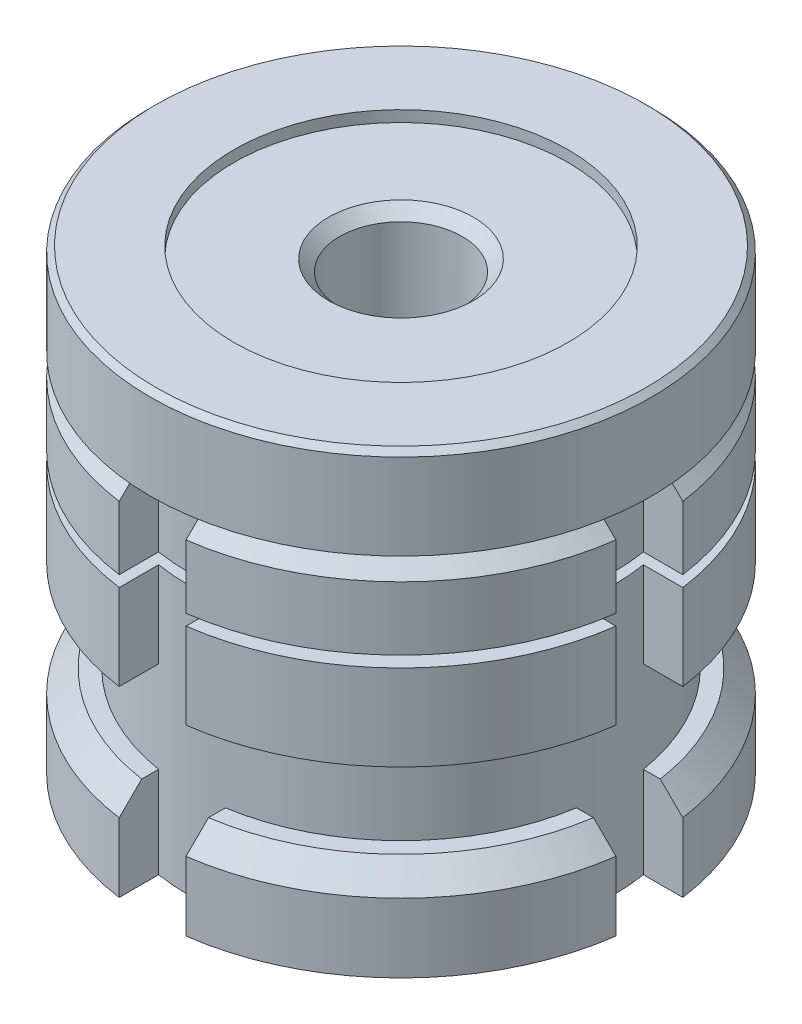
ISO-10303-21;
HEADER;
FILE_DESCRIPTION(('STEP AP214'),'2;1');
FILE_NAME('part.step','',(''),(''),'','','');
FILE_SCHEMA(('AUTOMOTIVE_DESIGN { 1 0 10303 214 1 1 1 1 }'));
ENDSEC;
DATA;
#1=APPLICATION_CONTEXT('core data for automotive mechanical design processes');
#2=APPLICATION_PROTOCOL_DEFINITION('international standard','automotive_design',2000,#1);
#3=PRODUCT_CONTEXT('',#1,'mechanical');
#4=PRODUCT('Part','Part','',(#3));
#5=PRODUCT_RELATED_PRODUCT_CATEGORY('part','',(#4));
#6=PRODUCT_DEFINITION_FORMATION('','',#4);
#7=PRODUCT_DEFINITION_CONTEXT('part definition',#1,'design');
#8=PRODUCT_DEFINITION('design','',#6,#7);
#9=PRODUCT_DEFINITION_SHAPE('','',#8);
#10=(LENGTH_UNIT() NAMED_UNIT(*) SI_UNIT(.MILLI.,.METRE.));
#11=(NAMED_UNIT(*) PLANE_ANGLE_UNIT() SI_UNIT($,.RADIAN.));
#12=(NAMED_UNIT(*) SI_UNIT($,.STERADIAN.) SOLID_ANGLE_UNIT());
#13=UNCERTAINTY_MEASURE_WITH_UNIT(LENGTH_MEASURE(1.E-05),#10,'distance_accuracy_value','');
#14=(GEOMETRIC_REPRESENTATION_CONTEXT(3) GLOBAL_UNCERTAINTY_ASSIGNED_CONTEXT((#13)) GLOBAL_UNIT_ASSIGNED_CONTEXT((#10,
#11,#12)) REPRESENTATION_CONTEXT('',''));
#15=CARTESIAN_POINT('',(0.,0.,0.));
#16=DIRECTION('',(0.,0.,1.));
#17=DIRECTION('',(1.,0.,0.));
#18=AXIS2_PLACEMENT_3D('',#15,#16,#17);
#19=CARTESIAN_POINT('',(0.,16.4,0.));
#20=DIRECTION('',(0.,-1.,0.));
#21=DIRECTION('',(0.,0.,-1.));
#22=AXIS2_PLACEMENT_3D('',#19,#20,#21);
#23=CYLINDRICAL_SURFACE('',#22,22.5);
#24=DIRECTION('',(0.,1.,0.));
#25=VECTOR('',#24,1.);
#26=CARTESIAN_POINT('',(-3.00000000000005,-23.4693113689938,22.2991031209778));
#27=LINE('',#26,#25);
#28=CARTESIAN_POINT('',(-3.00000000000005,8.7,22.2991031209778));
#29=VERTEX_POINT('',#28);
#30=CARTESIAN_POINT('',(-3.00000000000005,14.4,22.2991031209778));
#31=VERTEX_POINT('',#30);
#32=EDGE_CURVE('E1112',#29,#31,#27,.T.);
#33=ORIENTED_EDGE('',*,*,#32,.T.);
#34=CARTESIAN_POINT('',(0.,14.4,0.));
#35=DIRECTION('',(0.,1.,0.));
#36=DIRECTION('',(0.,0.,1.));
#37=AXIS2_PLACEMENT_3D('',#34,#35,#36);
#38=CIRCLE('',#37,22.5);
#39=CARTESIAN_POINT('',(-22.2991031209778,14.4,2.9999999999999));
#40=VERTEX_POINT('',#39);
#41=EDGE_CURVE('E55',#31,#40,#38,.F.);
#42=ORIENTED_EDGE('',*,*,#41,.T.);
#43=DIRECTION('',(0.,1.,0.));
#44=VECTOR('',#43,1.);
#45=CARTESIAN_POINT('',(-22.2991031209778,-23.4693113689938,2.9999999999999));
#46=LINE('',#45,#44);
#47=CARTESIAN_POINT('',(-22.2991031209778,8.7,2.9999999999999));
#48=VERTEX_POINT('',#47);
#49=EDGE_CURVE('E868',#48,#40,#46,.T.);
#50=ORIENTED_EDGE('',*,*,#49,.F.);
#51=CARTESIAN_POINT('',(0.,8.7,0.));
#52=DIRECTION('',(0.,1.,0.));
#53=DIRECTION('',(0.,0.,1.));
#54=AXIS2_PLACEMENT_3D('',#51,#52,#53);
#55=CIRCLE('',#54,22.5);
#56=EDGE_CURVE('E588',#48,#29,#55,.T.);
#57=ORIENTED_EDGE('',*,*,#56,.T.);
#58=EDGE_LOOP('',(#33,#42,#50,#57));
#59=FACE_BOUND('',#58,.T.);
#60=ADVANCED_FACE('F39',(#59),#23,.T.);
#61=DIRECTION('',(0.,1.,0.));
#62=VECTOR('',#61,1.);
#63=CARTESIAN_POINT('',(-22.2991031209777,-23.4693113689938,-3.0000000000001));
#64=LINE('',#63,#62);
#65=CARTESIAN_POINT('',(-22.2991031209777,8.7,-3.0000000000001));
#66=VERTEX_POINT('',#65);
#67=CARTESIAN_POINT('',(-22.2991031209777,14.4,-3.0000000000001));
#68=VERTEX_POINT('',#67);
#69=EDGE_CURVE('E887',#66,#68,#64,.T.);
#70=ORIENTED_EDGE('',*,*,#69,.T.);
#71=CARTESIAN_POINT('',(0.,14.4,0.));
#72=DIRECTION('',(0.,1.,0.));
#73=DIRECTION('',(0.,0.,1.));
#74=AXIS2_PLACEMENT_3D('',#71,#72,#73);
#75=CIRCLE('',#74,22.5);
#76=CARTESIAN_POINT('',(-3.00000000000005,14.4,-22.2991031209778));
#77=VERTEX_POINT('',#76);
#78=EDGE_CURVE('E645',#68,#77,#75,.F.);
#79=ORIENTED_EDGE('',*,*,#78,.T.);
#80=DIRECTION('',(0.,1.,0.));
#81=VECTOR('',#80,1.);
#82=CARTESIAN_POINT('',(-3.00000000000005,-23.4693113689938,-22.2991031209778));
#83=LINE('',#82,#81);
#84=CARTESIAN_POINT('',(-3.00000000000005,8.7,-22.2991031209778));
#85=VERTEX_POINT('',#84);
#86=EDGE_CURVE('E463',#85,#77,#83,.T.);
#87=ORIENTED_EDGE('',*,*,#86,.F.);
#88=EDGE_CURVE('E1227',#85,#66,#55,.T.);
#89=ORIENTED_EDGE('',*,*,#88,.T.);
#90=EDGE_LOOP('',(#70,#79,#87,#89));
#91=FACE_BOUND('',#90,.T.);
#92=ADVANCED_FACE('F1243',(#91),#23,.T.);
#93=DIRECTION('',(0.,1.,0.));
#94=VECTOR('',#93,1.);
#95=CARTESIAN_POINT('',(22.2991031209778,-23.4693113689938,3.00000000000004));
#96=LINE('',#95,#94);
#97=CARTESIAN_POINT('',(22.2991031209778,8.7,3.00000000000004));
#98=VERTEX_POINT('',#97);
#99=CARTESIAN_POINT('',(22.2991031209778,14.4,3.00000000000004));
#100=VERTEX_POINT('',#99);
#101=EDGE_CURVE('E1020',#98,#100,#96,.T.);
#102=ORIENTED_EDGE('',*,*,#101,.T.);
#103=CARTESIAN_POINT('',(0.,14.4,0.));
#104=DIRECTION('',(0.,1.,0.));
#105=DIRECTION('',(0.,0.,1.));
#106=AXIS2_PLACEMENT_3D('',#103,#104,#105);
#107=CIRCLE('',#106,22.5);
#108=CARTESIAN_POINT('',(3.00000000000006,14.4,22.2991031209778));
#109=VERTEX_POINT('',#108);
#110=EDGE_CURVE('E728',#100,#109,#107,.F.);
#111=ORIENTED_EDGE('',*,*,#110,.T.);
#112=DIRECTION('',(0.,1.,0.));
#113=VECTOR('',#112,1.);
#114=CARTESIAN_POINT('',(3.00000000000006,-23.4693113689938,22.2991031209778));
#115=LINE('',#114,#113);
#116=CARTESIAN_POINT('',(3.00000000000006,8.7,22.2991031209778));
#117=VERTEX_POINT('',#116);
#118=EDGE_CURVE('E1101',#117,#109,#115,.T.);
#119=ORIENTED_EDGE('',*,*,#118,.F.);
#120=EDGE_CURVE('E589',#117,#98,#55,.T.);
#121=ORIENTED_EDGE('',*,*,#120,.T.);
#122=EDGE_LOOP('',(#102,#111,#119,#121));
#123=FACE_BOUND('',#122,.T.);
#124=ADVANCED_FACE('F1099',(#123),#23,.T.);
#125=CARTESIAN_POINT('',(0.,8.7,22.5));
#126=DIRECTION('',(0.,1.,0.));
#127=DIRECTION('',(0.,0.,1.));
#128=AXIS2_PLACEMENT_3D('',#125,#126,#127);
#129=PLANE('',#128);
#130=CARTESIAN_POINT('',(0.,8.7,0.));
#131=DIRECTION('',(0.,1.,0.));
#132=DIRECTION('',(0.,0.,1.));
#133=AXIS2_PLACEMENT_3D('',#130,#131,#132);
#134=CIRCLE('',#133,15.);
#135=CARTESIAN_POINT('',(0.,8.7,15.));
#136=VERTEX_POINT('',#135);
#137=EDGE_CURVE('E593',#136,#136,#134,.T.);
#138=ORIENTED_EDGE('',*,*,#137,.T.);
#139=EDGE_LOOP('',(#138));
#140=FACE_BOUND('',#139,.T.);
#141=ORIENTED_EDGE('',*,*,#56,.F.);
#142=DIRECTION('',(1.,0.,0.));
#143=VECTOR('',#142,1.);
#144=CARTESIAN_POINT('',(0.,8.7,2.99999999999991));
#145=LINE('',#144,#143);
#146=CARTESIAN_POINT('',(-18.7616630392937,8.7,2.9999999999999));
#147=VERTEX_POINT('',#146);
#148=EDGE_CURVE('E563',#48,#147,#145,.T.);
#149=ORIENTED_EDGE('',*,*,#148,.T.);
#150=CARTESIAN_POINT('',(0.,8.7,0.));
#151=DIRECTION('',(0.,1.,0.));
#152=DIRECTION('',(0.,0.,1.));
#153=AXIS2_PLACEMENT_3D('',#150,#151,#152);
#154=CIRCLE('',#153,19.);
#155=CARTESIAN_POINT('',(-18.7616630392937,8.7,-3.0000000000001));
#156=VERTEX_POINT('',#155);
#157=EDGE_CURVE('E547',#147,#156,#154,.F.);
#158=ORIENTED_EDGE('',*,*,#157,.T.);
#159=DIRECTION('',(-1.,0.,0.));
#160=VECTOR('',#159,1.);
#161=CARTESIAN_POINT('',(0.,8.7,-3.0000000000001));
#162=LINE('',#161,#160);
#163=EDGE_CURVE('E540',#156,#66,#162,.T.);
#164=ORIENTED_EDGE('',*,*,#163,.T.);
#165=ORIENTED_EDGE('',*,*,#88,.F.);
#166=DIRECTION('',(0.,0.,1.));
#167=VECTOR('',#166,1.);
#168=CARTESIAN_POINT('',(-3.00000000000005,8.7,22.5));
#169=LINE('',#168,#167);
#170=CARTESIAN_POINT('',(-3.00000000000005,8.7,-18.7616630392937));
#171=VERTEX_POINT('',#170);
#172=EDGE_CURVE('E526',#85,#171,#169,.T.);
#173=ORIENTED_EDGE('',*,*,#172,.T.);
#174=CARTESIAN_POINT('',(0.,8.7,0.));
#175=DIRECTION('',(0.,1.,0.));
#176=DIRECTION('',(0.,0.,1.));
#177=AXIS2_PLACEMENT_3D('',#174,#175,#176);
#178=CIRCLE('',#177,19.);
#179=CARTESIAN_POINT('',(3.00000000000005,8.7,-18.7616630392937));
#180=VERTEX_POINT('',#179);
#181=EDGE_CURVE('E422',#171,#180,#178,.F.);
#182=ORIENTED_EDGE('',*,*,#181,.T.);
#183=DIRECTION('',(0.,0.,-1.));
#184=VECTOR('',#183,1.);
#185=CARTESIAN_POINT('',(3.00000000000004,8.7,22.5));
#186=LINE('',#185,#184);
#187=CARTESIAN_POINT('',(3.00000000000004,8.7,-22.2991031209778));
#188=VERTEX_POINT('',#187);
#189=EDGE_CURVE('E500',#180,#188,#186,.T.);
#190=ORIENTED_EDGE('',*,*,#189,.T.);
#191=CARTESIAN_POINT('',(22.2991031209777,8.7,-3.0000000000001));
#192=VERTEX_POINT('',#191);
#193=EDGE_CURVE('E594',#192,#188,#55,.T.);
#194=ORIENTED_EDGE('',*,*,#193,.F.);
#195=DIRECTION('',(-1.,0.,0.));
#196=VECTOR('',#195,1.);
#197=CARTESIAN_POINT('',(0.,8.7,-3.0000000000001));
#198=LINE('',#197,#196);
#199=CARTESIAN_POINT('',(18.7616630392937,8.7,-3.0000000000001));
#200=VERTEX_POINT('',#199);
#201=EDGE_CURVE('E1065',#192,#200,#198,.T.);
#202=ORIENTED_EDGE('',*,*,#201,.T.);
#203=CARTESIAN_POINT('',(0.,8.7,0.));
#204=DIRECTION('',(0.,1.,0.));
#205=DIRECTION('',(0.,0.,1.));
#206=AXIS2_PLACEMENT_3D('',#203,#204,#205);
#207=CIRCLE('',#206,19.);
#208=CARTESIAN_POINT('',(18.7616630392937,8.7,3.00000000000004));
#209=VERTEX_POINT('',#208);
#210=EDGE_CURVE('E1063',#200,#209,#207,.F.);
#211=ORIENTED_EDGE('',*,*,#210,.T.);
#212=DIRECTION('',(1.,0.,0.));
#213=VECTOR('',#212,1.);
#214=CARTESIAN_POINT('',(0.,8.7,3.00000000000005));
#215=LINE('',#214,#213);
#216=EDGE_CURVE('E990',#209,#98,#215,.T.);
#217=ORIENTED_EDGE('',*,*,#216,.T.);
#218=ORIENTED_EDGE('',*,*,#120,.F.);
#219=DIRECTION('',(0.,0.,-1.));
#220=VECTOR('',#219,1.);
#221=CARTESIAN_POINT('',(3.00000000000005,8.7,22.5));
#222=LINE('',#221,#220);
#223=CARTESIAN_POINT('',(3.00000000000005,8.7,18.7616630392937));
#224=VERTEX_POINT('',#223);
#225=EDGE_CURVE('E849',#117,#224,#222,.T.);
#226=ORIENTED_EDGE('',*,*,#225,.T.);
#227=CARTESIAN_POINT('',(0.,8.7,0.));
#228=DIRECTION('',(0.,1.,0.));
#229=DIRECTION('',(0.,0.,1.));
#230=AXIS2_PLACEMENT_3D('',#227,#228,#229);
#231=CIRCLE('',#230,19.);
#232=CARTESIAN_POINT('',(-3.00000000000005,8.7,18.7616630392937));
#233=VERTEX_POINT('',#232);
#234=EDGE_CURVE('E873',#224,#233,#231,.F.);
#235=ORIENTED_EDGE('',*,*,#234,.T.);
#236=DIRECTION('',(0.,0.,1.));
#237=VECTOR('',#236,1.);
#238=CARTESIAN_POINT('',(-3.00000000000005,8.7,22.5));
#239=LINE('',#238,#237);
#240=EDGE_CURVE('E1157',#233,#29,#239,.T.);
#241=ORIENTED_EDGE('',*,*,#240,.T.);
#242=EDGE_LOOP('',(#141,#149,#158,#164,#165,#173,#182,#190,#194,#202,#211,#217,#218,#226,#235,#241));
#243=FACE_BOUND('',#242,.T.);
#244=ADVANCED_FACE('F1069',(#140,#243),#129,.F.);
#245=CARTESIAN_POINT('',(0.,7.7,22.5));
#246=DIRECTION('',(0.,-1.,0.));
#247=DIRECTION('',(0.,0.,-1.));
#248=AXIS2_PLACEMENT_3D('',#245,#246,#247);
#249=PLANE('',#248);
#250=CARTESIAN_POINT('',(0.,7.7,0.));
#251=DIRECTION('',(0.,1.,0.));
#252=DIRECTION('',(0.,0.,1.));
#253=AXIS2_PLACEMENT_3D('',#250,#251,#252);
#254=CIRCLE('',#253,15.);
#255=CARTESIAN_POINT('',(0.,7.7,15.));
#256=VERTEX_POINT('',#255);
#257=EDGE_CURVE('E572',#256,#256,#254,.T.);
#258=ORIENTED_EDGE('',*,*,#257,.F.);
#259=EDGE_LOOP('',(#258));
#260=FACE_BOUND('',#259,.T.);
#261=CARTESIAN_POINT('',(0.,7.7,0.));
#262=DIRECTION('',(0.,-1.,0.));
#263=DIRECTION('',(0.,0.,-1.));
#264=AXIS2_PLACEMENT_3D('',#261,#262,#263);
#265=CIRCLE('',#264,19.);
#266=CARTESIAN_POINT('',(-18.7616630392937,7.7,-3.0000000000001));
#267=VERTEX_POINT('',#266);
#268=CARTESIAN_POINT('',(-18.7616630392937,7.7,2.9999999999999));
#269=VERTEX_POINT('',#268);
#270=EDGE_CURVE('E544',#267,#269,#265,.F.);
#271=ORIENTED_EDGE('',*,*,#270,.T.);
#272=DIRECTION('',(-1.,0.,0.));
#273=VECTOR('',#272,1.);
#274=CARTESIAN_POINT('',(0.,7.7,2.99999999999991));
#275=LINE('',#274,#273);
#276=CARTESIAN_POINT('',(-22.2991031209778,7.7,2.9999999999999));
#277=VERTEX_POINT('',#276);
#278=EDGE_CURVE('E559',#269,#277,#275,.T.);
#279=ORIENTED_EDGE('',*,*,#278,.T.);
#280=CARTESIAN_POINT('',(0.,7.7,0.));
#281=DIRECTION('',(0.,1.,0.));
#282=DIRECTION('',(0.,0.,1.));
#283=AXIS2_PLACEMENT_3D('',#280,#281,#282);
#284=CIRCLE('',#283,22.5);
#285=CARTESIAN_POINT('',(-3.00000000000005,7.7,22.2991031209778));
#286=VERTEX_POINT('',#285);
#287=EDGE_CURVE('E583',#277,#286,#284,.T.);
#288=ORIENTED_EDGE('',*,*,#287,.T.);
#289=DIRECTION('',(0.,0.,-1.));
#290=VECTOR('',#289,1.);
#291=CARTESIAN_POINT('',(-3.00000000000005,7.7,22.5));
#292=LINE('',#291,#290);
#293=CARTESIAN_POINT('',(-3.00000000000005,7.7,18.7616630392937));
#294=VERTEX_POINT('',#293);
#295=EDGE_CURVE('E1152',#286,#294,#292,.T.);
#296=ORIENTED_EDGE('',*,*,#295,.T.);
#297=CARTESIAN_POINT('',(0.,7.7,0.));
#298=DIRECTION('',(0.,-1.,0.));
#299=DIRECTION('',(0.,0.,-1.));
#300=AXIS2_PLACEMENT_3D('',#297,#298,#299);
#301=CIRCLE('',#300,19.);
#302=CARTESIAN_POINT('',(3.00000000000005,7.7,18.7616630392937));
#303=VERTEX_POINT('',#302);
#304=EDGE_CURVE('E865',#294,#303,#301,.F.);
#305=ORIENTED_EDGE('',*,*,#304,.T.);
#306=DIRECTION('',(0.,0.,1.));
#307=VECTOR('',#306,1.);
#308=CARTESIAN_POINT('',(3.00000000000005,7.7,22.5));
#309=LINE('',#308,#307);
#310=CARTESIAN_POINT('',(3.00000000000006,7.7,22.2991031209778));
#311=VERTEX_POINT('',#310);
#312=EDGE_CURVE('E1149',#303,#311,#309,.T.);
#313=ORIENTED_EDGE('',*,*,#312,.T.);
#314=CARTESIAN_POINT('',(22.2991031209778,7.7,3.00000000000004));
#315=VERTEX_POINT('',#314);
#316=EDGE_CURVE('E584',#311,#315,#284,.T.);
#317=ORIENTED_EDGE('',*,*,#316,.T.);
#318=DIRECTION('',(-1.,0.,0.));
#319=VECTOR('',#318,1.);
#320=CARTESIAN_POINT('',(0.,7.7,3.00000000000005));
#321=LINE('',#320,#319);
#322=CARTESIAN_POINT('',(18.7616630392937,7.7,3.00000000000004));
#323=VERTEX_POINT('',#322);
#324=EDGE_CURVE('E1089',#315,#323,#321,.T.);
#325=ORIENTED_EDGE('',*,*,#324,.T.);
#326=CARTESIAN_POINT('',(0.,7.7,0.));
#327=DIRECTION('',(0.,-1.,0.));
#328=DIRECTION('',(0.,0.,-1.));
#329=AXIS2_PLACEMENT_3D('',#326,#327,#328);
#330=CIRCLE('',#329,19.);
#331=CARTESIAN_POINT('',(18.7616630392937,7.7,-3.0000000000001));
#332=VERTEX_POINT('',#331);
#333=EDGE_CURVE('E1162',#323,#332,#330,.F.);
#334=ORIENTED_EDGE('',*,*,#333,.T.);
#335=DIRECTION('',(1.,0.,0.));
#336=VECTOR('',#335,1.);
#337=CARTESIAN_POINT('',(0.,7.7,-3.0000000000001));
#338=LINE('',#337,#336);
#339=CARTESIAN_POINT('',(22.2991031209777,7.7,-3.0000000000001));
#340=VERTEX_POINT('',#339);
#341=EDGE_CURVE('E1074',#332,#340,#338,.T.);
#342=ORIENTED_EDGE('',*,*,#341,.T.);
#343=CARTESIAN_POINT('',(3.00000000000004,7.7,-22.2991031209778));
#344=VERTEX_POINT('',#343);
#345=EDGE_CURVE('E498',#340,#344,#284,.T.);
#346=ORIENTED_EDGE('',*,*,#345,.T.);
#347=DIRECTION('',(0.,0.,1.));
#348=VECTOR('',#347,1.);
#349=CARTESIAN_POINT('',(3.00000000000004,7.7,22.5));
#350=LINE('',#349,#348);
#351=CARTESIAN_POINT('',(3.00000000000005,7.7,-18.7616630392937));
#352=VERTEX_POINT('',#351);
#353=EDGE_CURVE('E482',#344,#352,#350,.T.);
#354=ORIENTED_EDGE('',*,*,#353,.T.);
#355=CARTESIAN_POINT('',(0.,7.7,0.));
#356=DIRECTION('',(0.,-1.,0.));
#357=DIRECTION('',(0.,0.,-1.));
#358=AXIS2_PLACEMENT_3D('',#355,#356,#357);
#359=CIRCLE('',#358,19.);
#360=CARTESIAN_POINT('',(-3.00000000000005,7.7,-18.7616630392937));
#361=VERTEX_POINT('',#360);
#362=EDGE_CURVE('E495',#352,#361,#359,.F.);
#363=ORIENTED_EDGE('',*,*,#362,.T.);
#364=DIRECTION('',(0.,0.,-1.));
#365=VECTOR('',#364,1.);
#366=CARTESIAN_POINT('',(-3.00000000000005,7.7,22.5));
#367=LINE('',#366,#365);
#368=CARTESIAN_POINT('',(-3.00000000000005,7.7,-22.2991031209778));
#369=VERTEX_POINT('',#368);
#370=EDGE_CURVE('E523',#361,#369,#367,.T.);
#371=ORIENTED_EDGE('',*,*,#370,.T.);
#372=CARTESIAN_POINT('',(-22.2991031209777,7.7,-3.0000000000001));
#373=VERTEX_POINT('',#372);
#374=EDGE_CURVE('E1312',#369,#373,#284,.T.);
#375=ORIENTED_EDGE('',*,*,#374,.T.);
#376=DIRECTION('',(1.,0.,0.));
#377=VECTOR('',#376,1.);
#378=CARTESIAN_POINT('',(0.,7.7,-3.0000000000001));
#379=LINE('',#378,#377);
#380=EDGE_CURVE('E536',#373,#267,#379,.T.);
#381=ORIENTED_EDGE('',*,*,#380,.T.);
#382=EDGE_LOOP('',(#271,#279,#288,#296,#305,#313,#317,#325,#334,#342,#346,#354,#363,#371,#375,#381));
#383=FACE_BOUND('',#382,.T.);
#384=ADVANCED_FACE('F493',(#260,#383),#249,.F.);
#385=CARTESIAN_POINT('',(0.,0.,0.));
#386=DIRECTION('',(0.,1.,0.));
#387=DIRECTION('',(0.,0.,1.));
#388=AXIS2_PLACEMENT_3D('',#385,#386,#387);
#389=PLANE('',#388);
#390=CARTESIAN_POINT('',(0.,0.,0.));
#391=DIRECTION('',(0.,1.,0.));
#392=DIRECTION('',(0.,0.,1.));
#393=AXIS2_PLACEMENT_3D('',#390,#391,#392);
#394=CIRCLE('',#393,22.5);
#395=CARTESIAN_POINT('',(-22.2991031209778,0.,2.9999999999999));
#396=VERTEX_POINT('',#395);
#397=CARTESIAN_POINT('',(-3.00000000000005,0.,22.2991031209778));
#398=VERTEX_POINT('',#397);
#399=EDGE_CURVE('E598',#396,#398,#394,.T.);
#400=ORIENTED_EDGE('',*,*,#399,.F.);
#401=DIRECTION('',(1.,0.,0.));
#402=VECTOR('',#401,1.);
#403=CARTESIAN_POINT('',(0.,0.,2.9999999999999));
#404=LINE('',#403,#402);
#405=CARTESIAN_POINT('',(-18.7616630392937,0.,2.9999999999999));
#406=VERTEX_POINT('',#405);
#407=EDGE_CURVE('E555',#396,#406,#404,.T.);
#408=ORIENTED_EDGE('',*,*,#407,.T.);
#409=CARTESIAN_POINT('',(0.,0.,0.));
#410=DIRECTION('',(0.,-1.,0.));
#411=DIRECTION('',(0.,0.,-1.));
#412=AXIS2_PLACEMENT_3D('',#409,#410,#411);
#413=CIRCLE('',#412,19.);
#414=CARTESIAN_POINT('',(-3.00000000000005,0.,18.7616630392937));
#415=VERTEX_POINT('',#414);
#416=EDGE_CURVE('E1295',#415,#406,#413,.T.);
#417=ORIENTED_EDGE('',*,*,#416,.F.);
#418=DIRECTION('',(0.,0.,1.));
#419=VECTOR('',#418,1.);
#420=CARTESIAN_POINT('',(-3.00000000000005,0.,0.));
#421=LINE('',#420,#419);
#422=EDGE_CURVE('E848',#415,#398,#421,.T.);
#423=ORIENTED_EDGE('',*,*,#422,.T.);
#424=EDGE_LOOP('',(#400,#408,#417,#423));
#425=FACE_BOUND('',#424,.T.);
#426=ADVANCED_FACE('F1258',(#425),#389,.F.);
#427=CARTESIAN_POINT('',(-18.7616630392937,0.,-3.0000000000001));
#428=VERTEX_POINT('',#427);
#429=CARTESIAN_POINT('',(-3.00000000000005,0.,-18.7616630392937));
#430=VERTEX_POINT('',#429);
#431=EDGE_CURVE('E579',#428,#430,#413,.T.);
#432=ORIENTED_EDGE('',*,*,#431,.F.);
#433=DIRECTION('',(-1.,0.,0.));
#434=VECTOR('',#433,1.);
#435=CARTESIAN_POINT('',(0.,0.,-3.0000000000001));
#436=LINE('',#435,#434);
#437=CARTESIAN_POINT('',(-22.2991031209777,0.,-3.0000000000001));
#438=VERTEX_POINT('',#437);
#439=EDGE_CURVE('E532',#428,#438,#436,.T.);
#440=ORIENTED_EDGE('',*,*,#439,.T.);
#441=CARTESIAN_POINT('',(-3.00000000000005,0.,-22.2991031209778));
#442=VERTEX_POINT('',#441);
#443=EDGE_CURVE('E1284',#442,#438,#394,.T.);
#444=ORIENTED_EDGE('',*,*,#443,.F.);
#445=DIRECTION('',(0.,0.,1.));
#446=VECTOR('',#445,1.);
#447=CARTESIAN_POINT('',(-3.00000000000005,0.,0.));
#448=LINE('',#447,#446);
#449=EDGE_CURVE('E519',#442,#430,#448,.T.);
#450=ORIENTED_EDGE('',*,*,#449,.T.);
#451=EDGE_LOOP('',(#432,#440,#444,#450));
#452=FACE_BOUND('',#451,.T.);
#453=ADVANCED_FACE('F1310',(#452),#389,.F.);
#454=CARTESIAN_POINT('',(18.7616630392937,0.,3.00000000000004));
#455=VERTEX_POINT('',#454);
#456=CARTESIAN_POINT('',(3.00000000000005,0.,18.7616630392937));
#457=VERTEX_POINT('',#456);
#458=EDGE_CURVE('E578',#455,#457,#413,.T.);
#459=ORIENTED_EDGE('',*,*,#458,.F.);
#460=DIRECTION('',(1.,0.,0.));
#461=VECTOR('',#460,1.);
#462=CARTESIAN_POINT('',(0.,0.,3.00000000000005));
#463=LINE('',#462,#461);
#464=CARTESIAN_POINT('',(22.2991031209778,0.,3.00000000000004));
#465=VERTEX_POINT('',#464);
#466=EDGE_CURVE('E1079',#455,#465,#463,.T.);
#467=ORIENTED_EDGE('',*,*,#466,.T.);
#468=CARTESIAN_POINT('',(3.00000000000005,0.,22.2991031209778));
#469=VERTEX_POINT('',#468);
#470=EDGE_CURVE('E599',#469,#465,#394,.T.);
#471=ORIENTED_EDGE('',*,*,#470,.F.);
#472=DIRECTION('',(0.,0.,-1.));
#473=VECTOR('',#472,1.);
#474=CARTESIAN_POINT('',(3.00000000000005,0.,0.));
#475=LINE('',#474,#473);
#476=EDGE_CURVE('E1189',#469,#457,#475,.T.);
#477=ORIENTED_EDGE('',*,*,#476,.T.);
#478=EDGE_LOOP('',(#459,#467,#471,#477));
#479=FACE_BOUND('',#478,.T.);
#480=ADVANCED_FACE('F1188',(#479),#389,.F.);
#481=ORIENTED_EDGE('',*,*,#287,.F.);
#482=EDGE_CURVE('E866',#396,#277,#46,.T.);
#483=ORIENTED_EDGE('',*,*,#482,.F.);
#484=ORIENTED_EDGE('',*,*,#399,.T.);
#485=EDGE_CURVE('E1110',#398,#286,#27,.T.);
#486=ORIENTED_EDGE('',*,*,#485,.T.);
#487=EDGE_LOOP('',(#481,#483,#484,#486));
#488=FACE_BOUND('',#487,.T.);
#489=ADVANCED_FACE('F1275',(#488),#23,.T.);
#490=ORIENTED_EDGE('',*,*,#443,.T.);
#491=EDGE_CURVE('E885',#438,#373,#64,.T.);
#492=ORIENTED_EDGE('',*,*,#491,.T.);
#493=ORIENTED_EDGE('',*,*,#374,.F.);
#494=EDGE_CURVE('E952',#442,#369,#83,.T.);
#495=ORIENTED_EDGE('',*,*,#494,.F.);
#496=EDGE_LOOP('',(#490,#492,#493,#495));
#497=FACE_BOUND('',#496,.T.);
#498=ADVANCED_FACE('F1269',(#497),#23,.T.);
#499=ORIENTED_EDGE('',*,*,#470,.T.);
#500=EDGE_CURVE('E1019',#465,#315,#96,.T.);
#501=ORIENTED_EDGE('',*,*,#500,.T.);
#502=ORIENTED_EDGE('',*,*,#316,.F.);
#503=EDGE_CURVE('E1104',#469,#311,#115,.T.);
#504=ORIENTED_EDGE('',*,*,#503,.F.);
#505=EDGE_LOOP('',(#499,#501,#502,#504));
#506=FACE_BOUND('',#505,.T.);
#507=ADVANCED_FACE('F1184',(#506),#23,.T.);
#508=CARTESIAN_POINT('',(0.,-8.2,0.));
#509=DIRECTION('',(0.,-1.,0.));
#510=DIRECTION('',(0.,0.,-1.));
#511=AXIS2_PLACEMENT_3D('',#508,#509,#510);
#512=CYLINDRICAL_SURFACE('',#511,22.5);
#513=CARTESIAN_POINT('',(-3.00000000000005,-16.4,22.2991031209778));
#514=VERTEX_POINT('',#513);
#515=CARTESIAN_POINT('',(-3.00000000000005,-10.2,22.2991031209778));
#516=VERTEX_POINT('',#515);
#517=EDGE_CURVE('E859',#514,#516,#27,.T.);
#518=ORIENTED_EDGE('',*,*,#517,.T.);
#519=CARTESIAN_POINT('',(0.,-10.2,0.));
#520=DIRECTION('',(0.,-1.,0.));
#521=DIRECTION('',(0.,0.,-1.));
#522=AXIS2_PLACEMENT_3D('',#519,#520,#521);
#523=CIRCLE('',#522,22.5);
#524=CARTESIAN_POINT('',(-22.2991031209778,-10.2,2.9999999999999));
#525=VERTEX_POINT('',#524);
#526=EDGE_CURVE('E776',#516,#525,#523,.T.);
#527=ORIENTED_EDGE('',*,*,#526,.T.);
#528=CARTESIAN_POINT('',(-22.2991031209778,-16.4,2.9999999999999));
#529=VERTEX_POINT('',#528);
#530=EDGE_CURVE('E857',#529,#525,#46,.T.);
#531=ORIENTED_EDGE('',*,*,#530,.F.);
#532=CARTESIAN_POINT('',(0.,-16.4,0.));
#533=DIRECTION('',(0.,-1.,0.));
#534=DIRECTION('',(0.,0.,-1.));
#535=AXIS2_PLACEMENT_3D('',#532,#533,#534);
#536=CIRCLE('',#535,22.5);
#537=EDGE_CURVE('E1316',#514,#529,#536,.T.);
#538=ORIENTED_EDGE('',*,*,#537,.F.);
#539=EDGE_LOOP('',(#518,#527,#531,#538));
#540=FACE_BOUND('',#539,.T.);
#541=ADVANCED_FACE('F855',(#540),#512,.T.);
#542=CARTESIAN_POINT('',(-22.2991031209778,-16.4,-3.0000000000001));
#543=VERTEX_POINT('',#542);
#544=CARTESIAN_POINT('',(-22.2991031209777,-10.2,-3.0000000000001));
#545=VERTEX_POINT('',#544);
#546=EDGE_CURVE('E879',#543,#545,#64,.T.);
#547=ORIENTED_EDGE('',*,*,#546,.T.);
#548=CARTESIAN_POINT('',(0.,-10.2,0.));
#549=DIRECTION('',(0.,-1.,0.));
#550=DIRECTION('',(0.,0.,-1.));
#551=AXIS2_PLACEMENT_3D('',#548,#549,#550);
#552=CIRCLE('',#551,22.5);
#553=CARTESIAN_POINT('',(-3.00000000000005,-10.2,-22.2991031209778));
#554=VERTEX_POINT('',#553);
#555=EDGE_CURVE('E607',#545,#554,#552,.T.);
#556=ORIENTED_EDGE('',*,*,#555,.T.);
#557=CARTESIAN_POINT('',(-3.00000000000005,-16.4,-22.2991031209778));
#558=VERTEX_POINT('',#557);
#559=EDGE_CURVE('E949',#558,#554,#83,.T.);
#560=ORIENTED_EDGE('',*,*,#559,.F.);
#561=EDGE_CURVE('E567',#543,#558,#536,.T.);
#562=ORIENTED_EDGE('',*,*,#561,.F.);
#563=EDGE_LOOP('',(#547,#556,#560,#562));
#564=FACE_BOUND('',#563,.T.);
#565=ADVANCED_FACE('F1274',(#564),#512,.T.);
#566=CARTESIAN_POINT('',(22.2991031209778,-16.4,3.00000000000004));
#567=VERTEX_POINT('',#566);
#568=CARTESIAN_POINT('',(22.2991031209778,-10.2,3.00000000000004));
#569=VERTEX_POINT('',#568);
#570=EDGE_CURVE('E1015',#567,#569,#96,.T.);
#571=ORIENTED_EDGE('',*,*,#570,.T.);
#572=CARTESIAN_POINT('',(0.,-10.2,0.));
#573=DIRECTION('',(0.,-1.,0.));
#574=DIRECTION('',(0.,0.,-1.));
#575=AXIS2_PLACEMENT_3D('',#572,#573,#574);
#576=CIRCLE('',#575,22.5);
#577=CARTESIAN_POINT('',(3.00000000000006,-10.2,22.2991031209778));
#578=VERTEX_POINT('',#577);
#579=EDGE_CURVE('E747',#569,#578,#576,.T.);
#580=ORIENTED_EDGE('',*,*,#579,.T.);
#581=CARTESIAN_POINT('',(3.00000000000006,-16.4,22.2991031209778));
#582=VERTEX_POINT('',#581);
#583=EDGE_CURVE('E1106',#582,#578,#115,.T.);
#584=ORIENTED_EDGE('',*,*,#583,.F.);
#585=EDGE_CURVE('E573',#567,#582,#536,.T.);
#586=ORIENTED_EDGE('',*,*,#585,.F.);
#587=EDGE_LOOP('',(#571,#580,#584,#586));
#588=FACE_BOUND('',#587,.T.);
#589=ADVANCED_FACE('F1256',(#588),#512,.T.);
#590=CARTESIAN_POINT('',(0.,-8.2,0.));
#591=DIRECTION('',(0.,-1.,0.));
#592=DIRECTION('',(0.,0.,-1.));
#593=AXIS2_PLACEMENT_3D('',#590,#591,#592);
#594=PLANE('',#593);
#595=DIRECTION('',(-1.,0.,0.));
#596=VECTOR('',#595,1.);
#597=CARTESIAN_POINT('',(0.,-8.2,2.9999999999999));
#598=LINE('',#597,#596);
#599=CARTESIAN_POINT('',(-18.7616630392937,-8.2,2.9999999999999));
#600=VERTEX_POINT('',#599);
#601=CARTESIAN_POINT('',(-20.2792997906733,-8.2,2.9999999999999));
#602=VERTEX_POINT('',#601);
#603=EDGE_CURVE('E551',#600,#602,#598,.T.);
#604=ORIENTED_EDGE('',*,*,#603,.T.);
#605=CARTESIAN_POINT('',(0.,-8.2,0.));
#606=DIRECTION('',(0.,-1.,0.));
#607=DIRECTION('',(0.,0.,-1.));
#608=AXIS2_PLACEMENT_3D('',#605,#606,#607);
#609=CIRCLE('',#608,20.5);
#610=CARTESIAN_POINT('',(-3.00000000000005,-8.2,20.2792997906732));
#611=VERTEX_POINT('',#610);
#612=EDGE_CURVE('E786',#602,#611,#609,.F.);
#613=ORIENTED_EDGE('',*,*,#612,.T.);
#614=DIRECTION('',(0.,0.,-1.));
#615=VECTOR('',#614,1.);
#616=CARTESIAN_POINT('',(-3.00000000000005,-8.2,0.));
#617=LINE('',#616,#615);
#618=CARTESIAN_POINT('',(-3.00000000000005,-8.2,18.7616630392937));
#619=VERTEX_POINT('',#618);
#620=EDGE_CURVE('E840',#611,#619,#617,.T.);
#621=ORIENTED_EDGE('',*,*,#620,.T.);
#622=CARTESIAN_POINT('',(0.,-8.2,0.));
#623=DIRECTION('',(0.,-1.,0.));
#624=DIRECTION('',(0.,0.,-1.));
#625=AXIS2_PLACEMENT_3D('',#622,#623,#624);
#626=CIRCLE('',#625,19.);
#627=EDGE_CURVE('E1323',#619,#600,#626,.T.);
#628=ORIENTED_EDGE('',*,*,#627,.T.);
#629=EDGE_LOOP('',(#604,#613,#621,#628));
#630=FACE_BOUND('',#629,.T.);
#631=ADVANCED_FACE('F838',(#630),#594,.F.);
#632=DIRECTION('',(0.,0.,-1.));
#633=VECTOR('',#632,1.);
#634=CARTESIAN_POINT('',(-3.00000000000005,-8.2,0.));
#635=LINE('',#634,#633);
#636=CARTESIAN_POINT('',(-3.00000000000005,-8.2,-18.7616630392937));
#637=VERTEX_POINT('',#636);
#638=CARTESIAN_POINT('',(-3.00000000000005,-8.2,-20.2792997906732));
#639=VERTEX_POINT('',#638);
#640=EDGE_CURVE('E516',#637,#639,#635,.T.);
#641=ORIENTED_EDGE('',*,*,#640,.T.);
#642=CARTESIAN_POINT('',(0.,-8.2,0.));
#643=DIRECTION('',(0.,-1.,0.));
#644=DIRECTION('',(0.,0.,-1.));
#645=AXIS2_PLACEMENT_3D('',#642,#643,#644);
#646=CIRCLE('',#645,20.5);
#647=CARTESIAN_POINT('',(-20.2792997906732,-8.2,-3.0000000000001));
#648=VERTEX_POINT('',#647);
#649=EDGE_CURVE('E620',#639,#648,#646,.F.);
#650=ORIENTED_EDGE('',*,*,#649,.T.);
#651=DIRECTION('',(1.,0.,0.));
#652=VECTOR('',#651,1.);
#653=CARTESIAN_POINT('',(0.,-8.2,-3.0000000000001));
#654=LINE('',#653,#652);
#655=CARTESIAN_POINT('',(-18.7616630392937,-8.2,-3.0000000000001));
#656=VERTEX_POINT('',#655);
#657=EDGE_CURVE('E529',#648,#656,#654,.T.);
#658=ORIENTED_EDGE('',*,*,#657,.T.);
#659=EDGE_CURVE('E577',#656,#637,#626,.T.);
#660=ORIENTED_EDGE('',*,*,#659,.T.);
#661=EDGE_LOOP('',(#641,#650,#658,#660));
#662=FACE_BOUND('',#661,.T.);
#663=ADVANCED_FACE('F1326',(#662),#594,.F.);
#664=DIRECTION('',(0.,0.,1.));
#665=VECTOR('',#664,1.);
#666=CARTESIAN_POINT('',(3.00000000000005,-8.2,0.));
#667=LINE('',#666,#665);
#668=CARTESIAN_POINT('',(3.00000000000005,-8.2,18.7616630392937));
#669=VERTEX_POINT('',#668);
#670=CARTESIAN_POINT('',(3.00000000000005,-8.2,20.2792997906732));
#671=VERTEX_POINT('',#670);
#672=EDGE_CURVE('E1214',#669,#671,#667,.T.);
#673=ORIENTED_EDGE('',*,*,#672,.T.);
#674=CARTESIAN_POINT('',(0.,-8.2,0.));
#675=DIRECTION('',(0.,-1.,0.));
#676=DIRECTION('',(0.,0.,-1.));
#677=AXIS2_PLACEMENT_3D('',#674,#675,#676);
#678=CIRCLE('',#677,20.5);
#679=CARTESIAN_POINT('',(20.2792997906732,-8.2,3.00000000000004));
#680=VERTEX_POINT('',#679);
#681=EDGE_CURVE('E767',#671,#680,#678,.F.);
#682=ORIENTED_EDGE('',*,*,#681,.T.);
#683=DIRECTION('',(-1.,0.,0.));
#684=VECTOR('',#683,1.);
#685=CARTESIAN_POINT('',(0.,-8.2,3.00000000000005));
#686=LINE('',#685,#684);
#687=CARTESIAN_POINT('',(18.7616630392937,-8.2,3.00000000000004));
#688=VERTEX_POINT('',#687);
#689=EDGE_CURVE('E1073',#680,#688,#686,.T.);
#690=ORIENTED_EDGE('',*,*,#689,.T.);
#691=EDGE_CURVE('E608',#688,#669,#626,.T.);
#692=ORIENTED_EDGE('',*,*,#691,.T.);
#693=EDGE_LOOP('',(#673,#682,#690,#692));
#694=FACE_BOUND('',#693,.T.);
#695=ADVANCED_FACE('F1321',(#694),#594,.F.);
#696=CARTESIAN_POINT('',(0.,-16.4,0.));
#697=DIRECTION('',(0.,-1.,0.));
#698=DIRECTION('',(0.,0.,-1.));
#699=AXIS2_PLACEMENT_3D('',#696,#697,#698);
#700=PLANE('',#699);
#701=CARTESIAN_POINT('',(0.,-16.4,0.));
#702=DIRECTION('',(0.,-1.,0.));
#703=DIRECTION('',(0.,0.,-1.));
#704=AXIS2_PLACEMENT_3D('',#701,#702,#703);
#705=CIRCLE('',#704,6.5);
#706=CARTESIAN_POINT('',(0.,-16.4,-6.5));
#707=VERTEX_POINT('',#706);
#708=EDGE_CURVE('E1818',#707,#707,#705,.F.);
#709=ORIENTED_EDGE('',*,*,#708,.T.);
#710=EDGE_LOOP('',(#709));
#711=FACE_BOUND('',#710,.T.);
#712=DIRECTION('',(1.,0.,0.));
#713=VECTOR('',#712,1.);
#714=CARTESIAN_POINT('',(-18.7616630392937,-16.4,2.9999999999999));
#715=LINE('',#714,#713);
#716=CARTESIAN_POINT('',(-18.7616630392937,-16.4,2.9999999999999));
#717=VERTEX_POINT('',#716);
#718=EDGE_CURVE('E863',#529,#717,#715,.T.);
#719=ORIENTED_EDGE('',*,*,#718,.T.);
#720=CARTESIAN_POINT('',(0.,-16.4,0.));
#721=DIRECTION('',(0.,-1.,0.));
#722=DIRECTION('',(0.,0.,-1.));
#723=AXIS2_PLACEMENT_3D('',#720,#721,#722);
#724=CIRCLE('',#723,19.);
#725=CARTESIAN_POINT('',(-18.7616630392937,-16.4,-3.0000000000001));
#726=VERTEX_POINT('',#725);
#727=EDGE_CURVE('E915',#717,#726,#724,.T.);
#728=ORIENTED_EDGE('',*,*,#727,.T.);
#729=DIRECTION('',(-1.,0.,0.));
#730=VECTOR('',#729,1.);
#731=CARTESIAN_POINT('',(-22.2991031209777,-16.4,-3.0000000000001));
#732=LINE('',#731,#730);
#733=EDGE_CURVE('E897',#726,#543,#732,.T.);
#734=ORIENTED_EDGE('',*,*,#733,.T.);
#735=ORIENTED_EDGE('',*,*,#561,.T.);
#736=DIRECTION('',(0.,0.,1.));
#737=VECTOR('',#736,1.);
#738=CARTESIAN_POINT('',(-3.00000000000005,-16.4,-22.2991031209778));
#739=LINE('',#738,#737);
#740=CARTESIAN_POINT('',(-3.00000000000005,-16.4,-18.7616630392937));
#741=VERTEX_POINT('',#740);
#742=EDGE_CURVE('E425',#558,#741,#739,.T.);
#743=ORIENTED_EDGE('',*,*,#742,.T.);
#744=CARTESIAN_POINT('',(0.,-16.4,0.));
#745=DIRECTION('',(0.,-1.,0.));
#746=DIRECTION('',(0.,0.,-1.));
#747=AXIS2_PLACEMENT_3D('',#744,#745,#746);
#748=CIRCLE('',#747,19.);
#749=CARTESIAN_POINT('',(3.00000000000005,-16.4,-18.7616630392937));
#750=VERTEX_POINT('',#749);
#751=EDGE_CURVE('E439',#741,#750,#748,.T.);
#752=ORIENTED_EDGE('',*,*,#751,.T.);
#753=DIRECTION('',(0.,0.,-1.));
#754=VECTOR('',#753,1.);
#755=CARTESIAN_POINT('',(3.00000000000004,-16.4,-18.7616630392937));
#756=LINE('',#755,#754);
#757=CARTESIAN_POINT('',(3.00000000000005,-16.4,-22.2991031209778));
#758=VERTEX_POINT('',#757);
#759=EDGE_CURVE('E459',#750,#758,#756,.T.);
#760=ORIENTED_EDGE('',*,*,#759,.T.);
#761=CARTESIAN_POINT('',(22.2991031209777,-16.4,-3.0000000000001));
#762=VERTEX_POINT('',#761);
#763=EDGE_CURVE('E568',#758,#762,#536,.T.);
#764=ORIENTED_EDGE('',*,*,#763,.T.);
#765=DIRECTION('',(-1.,0.,0.));
#766=VECTOR('',#765,1.);
#767=CARTESIAN_POINT('',(18.7616630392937,-16.4,-3.0000000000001));
#768=LINE('',#767,#766);
#769=CARTESIAN_POINT('',(18.7616630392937,-16.4,-3.0000000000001));
#770=VERTEX_POINT('',#769);
#771=EDGE_CURVE('E1001',#762,#770,#768,.T.);
#772=ORIENTED_EDGE('',*,*,#771,.T.);
#773=CARTESIAN_POINT('',(0.,-16.4,0.));
#774=DIRECTION('',(0.,-1.,0.));
#775=DIRECTION('',(0.,0.,-1.));
#776=AXIS2_PLACEMENT_3D('',#773,#774,#775);
#777=CIRCLE('',#776,19.);
#778=CARTESIAN_POINT('',(18.7616630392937,-16.4,3.00000000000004));
#779=VERTEX_POINT('',#778);
#780=EDGE_CURVE('E1048',#770,#779,#777,.T.);
#781=ORIENTED_EDGE('',*,*,#780,.T.);
#782=DIRECTION('',(1.,0.,0.));
#783=VECTOR('',#782,1.);
#784=CARTESIAN_POINT('',(22.2991031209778,-16.4,3.00000000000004));
#785=LINE('',#784,#783);
#786=EDGE_CURVE('E1030',#779,#567,#785,.T.);
#787=ORIENTED_EDGE('',*,*,#786,.T.);
#788=ORIENTED_EDGE('',*,*,#585,.T.);
#789=DIRECTION('',(0.,0.,-1.));
#790=VECTOR('',#789,1.);
#791=CARTESIAN_POINT('',(3.00000000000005,-16.4,22.2991031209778));
#792=LINE('',#791,#790);
#793=CARTESIAN_POINT('',(3.00000000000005,-16.4,18.7616630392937));
#794=VERTEX_POINT('',#793);
#795=EDGE_CURVE('E1115',#582,#794,#792,.T.);
#796=ORIENTED_EDGE('',*,*,#795,.T.);
#797=CARTESIAN_POINT('',(0.,-16.4,0.));
#798=DIRECTION('',(0.,-1.,0.));
#799=DIRECTION('',(0.,0.,-1.));
#800=AXIS2_PLACEMENT_3D('',#797,#798,#799);
#801=CIRCLE('',#800,19.);
#802=CARTESIAN_POINT('',(-3.00000000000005,-16.4,18.7616630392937));
#803=VERTEX_POINT('',#802);
#804=EDGE_CURVE('E1127',#794,#803,#801,.T.);
#805=ORIENTED_EDGE('',*,*,#804,.T.);
#806=DIRECTION('',(0.,0.,1.));
#807=VECTOR('',#806,1.);
#808=CARTESIAN_POINT('',(-3.00000000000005,-16.4,18.7616630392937));
#809=LINE('',#808,#807);
#810=EDGE_CURVE('E1195',#803,#514,#809,.T.);
#811=ORIENTED_EDGE('',*,*,#810,.T.);
#812=ORIENTED_EDGE('',*,*,#537,.T.);
#813=EDGE_LOOP('',(#719,#728,#734,#735,#743,#752,#760,#764,#772,#781,#787,#788,#796,#805,#811,#812));
#814=FACE_BOUND('',#813,.T.);
#815=ADVANCED_FACE('F1266',(#711,#814),#700,.T.);
#816=CARTESIAN_POINT('',(0.,-16.4,0.));
#817=DIRECTION('',(0.,1.,0.));
#818=DIRECTION('',(0.,0.,1.));
#819=AXIS2_PLACEMENT_3D('',#816,#817,#818);
#820=CYLINDRICAL_SURFACE('',#819,19.);
#821=DIRECTION('',(0.,1.,0.));
#822=VECTOR('',#821,1.);
#823=CARTESIAN_POINT('',(-18.7616630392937,-23.4693113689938,2.9999999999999));
#824=LINE('',#823,#822);
#825=EDGE_CURVE('E917',#717,#600,#824,.T.);
#826=ORIENTED_EDGE('',*,*,#825,.T.);
#827=ORIENTED_EDGE('',*,*,#627,.F.);
#828=DIRECTION('',(0.,1.,0.));
#829=VECTOR('',#828,1.);
#830=CARTESIAN_POINT('',(-3.00000000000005,-23.4693113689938,18.7616630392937));
#831=LINE('',#830,#829);
#832=EDGE_CURVE('E845',#803,#619,#831,.T.);
#833=ORIENTED_EDGE('',*,*,#832,.F.);
#834=ORIENTED_EDGE('',*,*,#804,.F.);
#835=DIRECTION('',(0.,1.,0.));
#836=VECTOR('',#835,1.);
#837=CARTESIAN_POINT('',(3.00000000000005,-23.4693113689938,18.7616630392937));
#838=LINE('',#837,#836);
#839=EDGE_CURVE('E1125',#794,#669,#838,.T.);
#840=ORIENTED_EDGE('',*,*,#839,.T.);
#841=ORIENTED_EDGE('',*,*,#691,.F.);
#842=DIRECTION('',(0.,1.,0.));
#843=VECTOR('',#842,1.);
#844=CARTESIAN_POINT('',(18.7616630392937,-23.4693113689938,3.00000000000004));
#845=LINE('',#844,#843);
#846=EDGE_CURVE('E418',#779,#688,#845,.T.);
#847=ORIENTED_EDGE('',*,*,#846,.F.);
#848=ORIENTED_EDGE('',*,*,#780,.F.);
#849=DIRECTION('',(0.,1.,0.));
#850=VECTOR('',#849,1.);
#851=CARTESIAN_POINT('',(18.7616630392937,-23.4693113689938,-3.0000000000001));
#852=LINE('',#851,#850);
#853=CARTESIAN_POINT('',(18.7616630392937,-8.2,-3.0000000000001));
#854=VERTEX_POINT('',#853);
#855=EDGE_CURVE('E1051',#770,#854,#852,.T.);
#856=ORIENTED_EDGE('',*,*,#855,.T.);
#857=CARTESIAN_POINT('',(3.00000000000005,-8.2,-18.7616630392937));
#858=VERTEX_POINT('',#857);
#859=EDGE_CURVE('E603',#858,#854,#626,.T.);
#860=ORIENTED_EDGE('',*,*,#859,.F.);
#861=DIRECTION('',(0.,1.,0.));
#862=VECTOR('',#861,1.);
#863=CARTESIAN_POINT('',(3.00000000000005,-23.4693113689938,-18.7616630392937));
#864=LINE('',#863,#862);
#865=EDGE_CURVE('E456',#750,#858,#864,.T.);
#866=ORIENTED_EDGE('',*,*,#865,.F.);
#867=ORIENTED_EDGE('',*,*,#751,.F.);
#868=DIRECTION('',(0.,1.,0.));
#869=VECTOR('',#868,1.);
#870=CARTESIAN_POINT('',(-3.00000000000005,-23.4693113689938,-18.7616630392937));
#871=LINE('',#870,#869);
#872=EDGE_CURVE('E427',#741,#637,#871,.T.);
#873=ORIENTED_EDGE('',*,*,#872,.T.);
#874=ORIENTED_EDGE('',*,*,#659,.F.);
#875=DIRECTION('',(0.,1.,0.));
#876=VECTOR('',#875,1.);
#877=CARTESIAN_POINT('',(-18.7616630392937,-23.4693113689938,-3.0000000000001));
#878=LINE('',#877,#876);
#879=EDGE_CURVE('E904',#726,#656,#878,.T.);
#880=ORIENTED_EDGE('',*,*,#879,.F.);
#881=ORIENTED_EDGE('',*,*,#727,.F.);
#882=EDGE_LOOP('',(#826,#827,#833,#834,#840,#841,#847,#848,#856,#860,#866,#867,#873,#874,#880,#881));
#883=FACE_BOUND('',#882,.T.);
#884=ORIENTED_EDGE('',*,*,#416,.T.);
#885=EDGE_CURVE('E922',#406,#269,#824,.T.);
#886=ORIENTED_EDGE('',*,*,#885,.T.);
#887=ORIENTED_EDGE('',*,*,#270,.F.);
#888=EDGE_CURVE('E911',#428,#267,#878,.T.);
#889=ORIENTED_EDGE('',*,*,#888,.F.);
#890=ORIENTED_EDGE('',*,*,#431,.T.);
#891=EDGE_CURVE('E424',#430,#361,#871,.T.);
#892=ORIENTED_EDGE('',*,*,#891,.T.);
#893=ORIENTED_EDGE('',*,*,#362,.F.);
#894=CARTESIAN_POINT('',(3.00000000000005,0.,-18.7616630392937));
#895=VERTEX_POINT('',#894);
#896=EDGE_CURVE('E455',#895,#352,#864,.T.);
#897=ORIENTED_EDGE('',*,*,#896,.F.);
#898=CARTESIAN_POINT('',(18.7616630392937,0.,-3.0000000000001));
#899=VERTEX_POINT('',#898);
#900=EDGE_CURVE('E574',#895,#899,#413,.T.);
#901=ORIENTED_EDGE('',*,*,#900,.T.);
#902=EDGE_CURVE('E1054',#899,#332,#852,.T.);
#903=ORIENTED_EDGE('',*,*,#902,.T.);
#904=ORIENTED_EDGE('',*,*,#333,.F.);
#905=EDGE_CURVE('E1182',#455,#323,#845,.T.);
#906=ORIENTED_EDGE('',*,*,#905,.F.);
#907=ORIENTED_EDGE('',*,*,#458,.T.);
#908=EDGE_CURVE('E1124',#457,#303,#838,.T.);
#909=ORIENTED_EDGE('',*,*,#908,.T.);
#910=ORIENTED_EDGE('',*,*,#304,.F.);
#911=EDGE_CURVE('E1209',#415,#294,#831,.T.);
#912=ORIENTED_EDGE('',*,*,#911,.F.);
#913=EDGE_LOOP('',(#884,#886,#887,#889,#890,#892,#893,#897,#901,#903,#904,#906,#907,#909,#910,#912));
#914=FACE_BOUND('',#913,.T.);
#915=ADVANCED_FACE('F1140',(#883,#914),#820,.T.);
#916=DIRECTION('',(0.,1.,0.));
#917=VECTOR('',#916,1.);
#918=CARTESIAN_POINT('',(3.00000000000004,-23.4693113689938,-22.2991031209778));
#919=LINE('',#918,#917);
#920=CARTESIAN_POINT('',(3.00000000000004,14.4,-22.2991031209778));
#921=VERTEX_POINT('',#920);
#922=EDGE_CURVE('E465',#188,#921,#919,.T.);
#923=ORIENTED_EDGE('',*,*,#922,.T.);
#924=CARTESIAN_POINT('',(0.,14.4,0.));
#925=DIRECTION('',(0.,1.,0.));
#926=DIRECTION('',(0.,0.,1.));
#927=AXIS2_PLACEMENT_3D('',#924,#925,#926);
#928=CIRCLE('',#927,22.5);
#929=CARTESIAN_POINT('',(22.2991031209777,14.4,-3.0000000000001));
#930=VERTEX_POINT('',#929);
#931=EDGE_CURVE('E722',#921,#930,#928,.F.);
#932=ORIENTED_EDGE('',*,*,#931,.T.);
#933=DIRECTION('',(0.,1.,0.));
#934=VECTOR('',#933,1.);
#935=CARTESIAN_POINT('',(22.2991031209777,-23.4693113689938,-3.0000000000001));
#936=LINE('',#935,#934);
#937=EDGE_CURVE('E1005',#192,#930,#936,.T.);
#938=ORIENTED_EDGE('',*,*,#937,.F.);
#939=ORIENTED_EDGE('',*,*,#193,.T.);
#940=EDGE_LOOP('',(#923,#932,#938,#939));
#941=FACE_BOUND('',#940,.T.);
#942=ADVANCED_FACE('F1232',(#941),#23,.T.);
#943=CARTESIAN_POINT('',(0.,13.2647697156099,0.));
#944=DIRECTION('',(0.,1.,0.));
#945=DIRECTION('',(0.,0.,1.));
#946=AXIS2_PLACEMENT_3D('',#943,#944,#945);
#947=CYLINDRICAL_SURFACE('',#946,15.);
#948=ORIENTED_EDGE('',*,*,#137,.F.);
#949=EDGE_LOOP('',(#948));
#950=FACE_BOUND('',#949,.T.);
#951=ORIENTED_EDGE('',*,*,#257,.T.);
#952=EDGE_LOOP('',(#951));
#953=FACE_BOUND('',#952,.T.);
#954=ADVANCED_FACE('F1257',(#950,#953),#947,.T.);
#955=ORIENTED_EDGE('',*,*,#900,.F.);
#956=DIRECTION('',(0.,0.,-1.));
#957=VECTOR('',#956,1.);
#958=CARTESIAN_POINT('',(3.00000000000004,0.,0.));
#959=LINE('',#958,#957);
#960=CARTESIAN_POINT('',(3.00000000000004,0.,-22.2991031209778));
#961=VERTEX_POINT('',#960);
#962=EDGE_CURVE('E485',#895,#961,#959,.T.);
#963=ORIENTED_EDGE('',*,*,#962,.T.);
#964=CARTESIAN_POINT('',(22.2991031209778,0.,-3.0000000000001));
#965=VERTEX_POINT('',#964);
#966=EDGE_CURVE('E602',#965,#961,#394,.T.);
#967=ORIENTED_EDGE('',*,*,#966,.F.);
#968=DIRECTION('',(-1.,0.,0.));
#969=VECTOR('',#968,1.);
#970=CARTESIAN_POINT('',(0.,0.,-3.0000000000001));
#971=LINE('',#970,#969);
#972=EDGE_CURVE('E1082',#965,#899,#971,.T.);
#973=ORIENTED_EDGE('',*,*,#972,.T.);
#974=EDGE_LOOP('',(#955,#963,#967,#973));
#975=FACE_BOUND('',#974,.T.);
#976=ADVANCED_FACE('F1175',(#975),#389,.F.);
#977=ORIENTED_EDGE('',*,*,#966,.T.);
#978=EDGE_CURVE('E464',#961,#344,#919,.T.);
#979=ORIENTED_EDGE('',*,*,#978,.T.);
#980=ORIENTED_EDGE('',*,*,#345,.F.);
#981=EDGE_CURVE('E1003',#965,#340,#936,.T.);
#982=ORIENTED_EDGE('',*,*,#981,.F.);
#983=EDGE_LOOP('',(#977,#979,#980,#982));
#984=FACE_BOUND('',#983,.T.);
#985=ADVANCED_FACE('F1244',(#984),#23,.T.);
#986=CARTESIAN_POINT('',(3.00000000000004,-10.2,-22.2991031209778));
#987=VERTEX_POINT('',#986);
#988=EDGE_CURVE('E460',#758,#987,#919,.T.);
#989=ORIENTED_EDGE('',*,*,#988,.T.);
#990=CARTESIAN_POINT('',(0.,-10.2,0.));
#991=DIRECTION('',(0.,-1.,0.));
#992=DIRECTION('',(0.,0.,-1.));
#993=AXIS2_PLACEMENT_3D('',#990,#991,#992);
#994=CIRCLE('',#993,22.5);
#995=CARTESIAN_POINT('',(22.2991031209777,-10.2,-3.0000000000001));
#996=VERTEX_POINT('',#995);
#997=EDGE_CURVE('E690',#987,#996,#994,.T.);
#998=ORIENTED_EDGE('',*,*,#997,.T.);
#999=EDGE_CURVE('E997',#762,#996,#936,.T.);
#1000=ORIENTED_EDGE('',*,*,#999,.F.);
#1001=ORIENTED_EDGE('',*,*,#763,.F.);
#1002=EDGE_LOOP('',(#989,#998,#1000,#1001));
#1003=FACE_BOUND('',#1002,.T.);
#1004=ADVANCED_FACE('F995',(#1003),#512,.T.);
#1005=DIRECTION('',(1.,0.,0.));
#1006=VECTOR('',#1005,1.);
#1007=CARTESIAN_POINT('',(0.,-8.2,-3.0000000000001));
#1008=LINE('',#1007,#1006);
#1009=CARTESIAN_POINT('',(20.2792997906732,-8.2,-3.0000000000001));
#1010=VERTEX_POINT('',#1009);
#1011=EDGE_CURVE('E987',#854,#1010,#1008,.T.);
#1012=ORIENTED_EDGE('',*,*,#1011,.T.);
#1013=CARTESIAN_POINT('',(0.,-8.2,0.));
#1014=DIRECTION('',(0.,-1.,0.));
#1015=DIRECTION('',(0.,0.,-1.));
#1016=AXIS2_PLACEMENT_3D('',#1013,#1014,#1015);
#1017=CIRCLE('',#1016,20.5);
#1018=CARTESIAN_POINT('',(3.00000000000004,-8.2,-20.2792997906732));
#1019=VERTEX_POINT('',#1018);
#1020=EDGE_CURVE('E700',#1010,#1019,#1017,.F.);
#1021=ORIENTED_EDGE('',*,*,#1020,.T.);
#1022=DIRECTION('',(0.,0.,1.));
#1023=VECTOR('',#1022,1.);
#1024=CARTESIAN_POINT('',(3.00000000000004,-8.2,0.));
#1025=LINE('',#1024,#1023);
#1026=EDGE_CURVE('E508',#1019,#858,#1025,.T.);
#1027=ORIENTED_EDGE('',*,*,#1026,.T.);
#1028=ORIENTED_EDGE('',*,*,#859,.T.);
#1029=EDGE_LOOP('',(#1012,#1021,#1027,#1028));
#1030=FACE_BOUND('',#1029,.T.);
#1031=ADVANCED_FACE('F986',(#1030),#594,.F.);
#1032=CARTESIAN_POINT('',(3.00000000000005,-23.4693113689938,22.2991031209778));
#1033=DIRECTION('',(1.,0.,0.));
#1034=DIRECTION('',(0.,0.,-1.));
#1035=AXIS2_PLACEMENT_3D('',#1032,#1033,#1034);
#1036=PLANE('',#1035);
#1037=ORIENTED_EDGE('',*,*,#583,.T.);
#1038=CARTESIAN_POINT('',(3.00000000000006,-10.2,22.2991031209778));
#1039=CARTESIAN_POINT('',(3.00000000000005,-9.86651087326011,21.9626235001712));
#1040=CARTESIAN_POINT('',(3.00000000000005,-9.5330996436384,21.6260667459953));
#1041=CARTESIAN_POINT('',(3.00000000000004,-8.86643297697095,20.9527989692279));
#1042=CARTESIAN_POINT('',(3.00000000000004,-8.533177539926,20.6160879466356));
#1043=CARTESIAN_POINT('',(3.00000000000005,-8.2,20.2792997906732));
#1044=B_SPLINE_CURVE_WITH_KNOTS('',3,(#1038,#1039,#1040,#1041,#1042,#1043),.UNSPECIFIED.,.F.,
.F.,(4,2,4),(0.,1.42123237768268,2.84246476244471),.UNSPECIFIED.);
#1045=EDGE_CURVE('E761',#578,#671,#1044,.T.);
#1046=ORIENTED_EDGE('',*,*,#1045,.T.);
#1047=ORIENTED_EDGE('',*,*,#672,.F.);
#1048=ORIENTED_EDGE('',*,*,#839,.F.);
#1049=ORIENTED_EDGE('',*,*,#795,.F.);
#1050=EDGE_LOOP('',(#1037,#1046,#1047,#1048,#1049));
#1051=FACE_BOUND('',#1050,.T.);
#1052=ADVANCED_FACE('F757',(#1051),#1036,.F.);
#1053=CARTESIAN_POINT('',(-3.00000000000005,-23.4693113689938,18.7616630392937));
#1054=DIRECTION('',(-1.,0.,0.));
#1055=DIRECTION('',(0.,0.,1.));
#1056=AXIS2_PLACEMENT_3D('',#1053,#1054,#1055);
#1057=PLANE('',#1056);
#1058=ORIENTED_EDGE('',*,*,#620,.F.);
#1059=CARTESIAN_POINT('',(-3.00000000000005,-8.2,20.2792997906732));
#1060=CARTESIAN_POINT('',(-3.00000000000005,-8.533177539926,20.6160879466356));
#1061=CARTESIAN_POINT('',(-3.00000000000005,-8.86643297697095,20.9527989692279));
#1062=CARTESIAN_POINT('',(-3.00000000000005,-9.53309964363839,21.6260667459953));
#1063=CARTESIAN_POINT('',(-3.00000000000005,-9.86651087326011,21.9626235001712));
#1064=CARTESIAN_POINT('',(-3.00000000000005,-10.2,22.2991031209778));
#1065=B_SPLINE_CURVE_WITH_KNOTS('',3,(#1059,#1060,#1061,#1062,#1063,#1064),.UNSPECIFIED.,.F.,
.F.,(4,2,4),(0.,1.42123238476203,2.84246476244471),.UNSPECIFIED.);
#1066=EDGE_CURVE('E823',#611,#516,#1065,.T.);
#1067=ORIENTED_EDGE('',*,*,#1066,.T.);
#1068=ORIENTED_EDGE('',*,*,#517,.F.);
#1069=ORIENTED_EDGE('',*,*,#810,.F.);
#1070=ORIENTED_EDGE('',*,*,#832,.T.);
#1071=EDGE_LOOP('',(#1058,#1067,#1068,#1069,#1070));
#1072=FACE_BOUND('',#1071,.T.);
#1073=ADVANCED_FACE('F843',(#1072),#1057,.F.);
#1074=CARTESIAN_POINT('',(18.7616630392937,-23.4693113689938,-3.0000000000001));
#1075=DIRECTION('',(0.,0.,-1.));
#1076=DIRECTION('',(-1.,0.,0.));
#1077=AXIS2_PLACEMENT_3D('',#1074,#1075,#1076);
#1078=PLANE('',#1077);
#1079=ORIENTED_EDGE('',*,*,#999,.T.);
#1080=CARTESIAN_POINT('',(22.2991031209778,-10.2,-3.0000000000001));
#1081=CARTESIAN_POINT('',(21.9626235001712,-9.86651087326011,-3.0000000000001));
#1082=CARTESIAN_POINT('',(21.6260667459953,-9.5330996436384,-3.0000000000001));
#1083=CARTESIAN_POINT('',(20.9527989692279,-8.86643297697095,-3.0000000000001));
#1084=CARTESIAN_POINT('',(20.6160879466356,-8.533177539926,-3.0000000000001));
#1085=CARTESIAN_POINT('',(20.2792997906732,-8.2,-3.0000000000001));
#1086=B_SPLINE_CURVE_WITH_KNOTS('',3,(#1080,#1081,#1082,#1083,#1084,#1085),.UNSPECIFIED.,.F.,
.F.,(4,2,4),(0.,1.42123237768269,2.84246476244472),.UNSPECIFIED.);
#1087=EDGE_CURVE('E694',#996,#1010,#1086,.T.);
#1088=ORIENTED_EDGE('',*,*,#1087,.T.);
#1089=ORIENTED_EDGE('',*,*,#1011,.F.);
#1090=ORIENTED_EDGE('',*,*,#855,.F.);
#1091=ORIENTED_EDGE('',*,*,#771,.F.);
#1092=EDGE_LOOP('',(#1079,#1088,#1089,#1090,#1091));
#1093=FACE_BOUND('',#1092,.T.);
#1094=ADVANCED_FACE('F709',(#1093),#1078,.F.);
#1095=CARTESIAN_POINT('',(22.2991031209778,-23.4693113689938,3.00000000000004));
#1096=DIRECTION('',(0.,0.,1.));
#1097=DIRECTION('',(1.,0.,0.));
#1098=AXIS2_PLACEMENT_3D('',#1095,#1096,#1097);
#1099=PLANE('',#1098);
#1100=ORIENTED_EDGE('',*,*,#689,.F.);
#1101=CARTESIAN_POINT('',(20.2792997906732,-8.2,3.00000000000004));
#1102=CARTESIAN_POINT('',(20.6160879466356,-8.533177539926,3.00000000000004));
#1103=CARTESIAN_POINT('',(20.9527989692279,-8.86643297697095,3.00000000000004));
#1104=CARTESIAN_POINT('',(21.6260667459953,-9.5330996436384,3.00000000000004));
#1105=CARTESIAN_POINT('',(21.9626235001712,-9.86651087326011,3.00000000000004));
#1106=CARTESIAN_POINT('',(22.2991031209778,-10.2,3.00000000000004));
#1107=B_SPLINE_CURVE_WITH_KNOTS('',3,(#1101,#1102,#1103,#1104,#1105,#1106),.UNSPECIFIED.,.F.,
.F.,(4,2,4),(0.,1.42123238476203,2.84246476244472),.UNSPECIFIED.);
#1108=EDGE_CURVE('E770',#680,#569,#1107,.T.);
#1109=ORIENTED_EDGE('',*,*,#1108,.T.);
#1110=ORIENTED_EDGE('',*,*,#570,.F.);
#1111=ORIENTED_EDGE('',*,*,#786,.F.);
#1112=ORIENTED_EDGE('',*,*,#846,.T.);
#1113=EDGE_LOOP('',(#1100,#1109,#1110,#1111,#1112));
#1114=FACE_BOUND('',#1113,.T.);
#1115=ADVANCED_FACE('F1404',(#1114),#1099,.F.);
#1116=CARTESIAN_POINT('',(3.00000000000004,-23.4693113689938,-18.7616630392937));
#1117=DIRECTION('',(1.,0.,0.));
#1118=DIRECTION('',(0.,0.,-1.));
#1119=AXIS2_PLACEMENT_3D('',#1116,#1117,#1118);
#1120=PLANE('',#1119);
#1121=ORIENTED_EDGE('',*,*,#1026,.F.);
#1122=CARTESIAN_POINT('',(3.00000000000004,-8.2,-20.2792997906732));
#1123=CARTESIAN_POINT('',(3.00000000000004,-8.533177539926,-20.6160879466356));
#1124=CARTESIAN_POINT('',(3.00000000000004,-8.86643297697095,-20.9527989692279));
#1125=CARTESIAN_POINT('',(3.00000000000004,-9.5330996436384,-21.6260667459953));
#1126=CARTESIAN_POINT('',(3.00000000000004,-9.86651087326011,-21.9626235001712));
#1127=CARTESIAN_POINT('',(3.00000000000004,-10.2,-22.2991031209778));
#1128=B_SPLINE_CURVE_WITH_KNOTS('',3,(#1122,#1123,#1124,#1125,#1126,#1127),.UNSPECIFIED.,.F.,
.F.,(4,2,4),(0.,1.42123238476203,2.84246476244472),.UNSPECIFIED.);
#1129=EDGE_CURVE('E973',#1019,#987,#1128,.T.);
#1130=ORIENTED_EDGE('',*,*,#1129,.T.);
#1131=ORIENTED_EDGE('',*,*,#988,.F.);
#1132=ORIENTED_EDGE('',*,*,#759,.F.);
#1133=ORIENTED_EDGE('',*,*,#865,.T.);
#1134=EDGE_LOOP('',(#1121,#1130,#1131,#1132,#1133));
#1135=FACE_BOUND('',#1134,.T.);
#1136=ADVANCED_FACE('F989',(#1135),#1120,.F.);
#1137=CARTESIAN_POINT('',(-3.00000000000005,-23.4693113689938,-22.2991031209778));
#1138=DIRECTION('',(-1.,0.,0.));
#1139=DIRECTION('',(0.,0.,1.));
#1140=AXIS2_PLACEMENT_3D('',#1137,#1138,#1139);
#1141=PLANE('',#1140);
#1142=ORIENTED_EDGE('',*,*,#559,.T.);
#1143=CARTESIAN_POINT('',(-3.00000000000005,-10.2,-22.2991031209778));
#1144=CARTESIAN_POINT('',(-3.00000000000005,-9.86651087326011,-21.9626235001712));
#1145=CARTESIAN_POINT('',(-3.00000000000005,-9.53309964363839,-21.6260667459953));
#1146=CARTESIAN_POINT('',(-3.00000000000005,-8.86643297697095,-20.9527989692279));
#1147=CARTESIAN_POINT('',(-3.00000000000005,-8.533177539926,-20.6160879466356));
#1148=CARTESIAN_POINT('',(-3.00000000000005,-8.2,-20.2792997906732));
#1149=B_SPLINE_CURVE_WITH_KNOTS('',3,(#1143,#1144,#1145,#1146,#1147,#1148),.UNSPECIFIED.,.F.,
.F.,(4,2,4),(0.,1.42123237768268,2.84246476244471),.UNSPECIFIED.);
#1150=EDGE_CURVE('E612',#554,#639,#1149,.T.);
#1151=ORIENTED_EDGE('',*,*,#1150,.T.);
#1152=ORIENTED_EDGE('',*,*,#640,.F.);
#1153=ORIENTED_EDGE('',*,*,#872,.F.);
#1154=ORIENTED_EDGE('',*,*,#742,.F.);
#1155=EDGE_LOOP('',(#1142,#1151,#1152,#1153,#1154));
#1156=FACE_BOUND('',#1155,.T.);
#1157=ADVANCED_FACE('F632',(#1156),#1141,.F.);
#1158=CARTESIAN_POINT('',(-22.2991031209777,-23.4693113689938,-3.0000000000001));
#1159=DIRECTION('',(0.,0.,-1.));
#1160=DIRECTION('',(-1.,0.,0.));
#1161=AXIS2_PLACEMENT_3D('',#1158,#1159,#1160);
#1162=PLANE('',#1161);
#1163=ORIENTED_EDGE('',*,*,#657,.F.);
#1164=CARTESIAN_POINT('',(-20.2792997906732,-8.2,-3.0000000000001));
#1165=CARTESIAN_POINT('',(-20.6160879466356,-8.533177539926,-3.0000000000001));
#1166=CARTESIAN_POINT('',(-20.9527989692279,-8.86643297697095,-3.0000000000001));
#1167=CARTESIAN_POINT('',(-21.6260667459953,-9.53309964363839,-3.0000000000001));
#1168=CARTESIAN_POINT('',(-21.9626235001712,-9.86651087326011,-3.0000000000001));
#1169=CARTESIAN_POINT('',(-22.2991031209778,-10.2,-3.0000000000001));
#1170=B_SPLINE_CURVE_WITH_KNOTS('',3,(#1164,#1165,#1166,#1167,#1168,#1169),.UNSPECIFIED.,.F.,
.F.,(4,2,4),(0.,1.42123238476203,2.84246476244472),.UNSPECIFIED.);
#1171=EDGE_CURVE('E684',#648,#545,#1170,.T.);
#1172=ORIENTED_EDGE('',*,*,#1171,.T.);
#1173=ORIENTED_EDGE('',*,*,#546,.F.);
#1174=ORIENTED_EDGE('',*,*,#733,.F.);
#1175=ORIENTED_EDGE('',*,*,#879,.T.);
#1176=EDGE_LOOP('',(#1163,#1172,#1173,#1174,#1175));
#1177=FACE_BOUND('',#1176,.T.);
#1178=ADVANCED_FACE('F679',(#1177),#1162,.F.);
#1179=CARTESIAN_POINT('',(-18.7616630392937,-23.4693113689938,2.9999999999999));
#1180=DIRECTION('',(0.,0.,1.));
#1181=DIRECTION('',(1.,0.,0.));
#1182=AXIS2_PLACEMENT_3D('',#1179,#1180,#1181);
#1183=PLANE('',#1182);
#1184=ORIENTED_EDGE('',*,*,#530,.T.);
#1185=CARTESIAN_POINT('',(-22.2991031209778,-10.2,2.9999999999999));
#1186=CARTESIAN_POINT('',(-21.9626235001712,-9.86651087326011,2.9999999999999));
#1187=CARTESIAN_POINT('',(-21.6260667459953,-9.53309964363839,2.9999999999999));
#1188=CARTESIAN_POINT('',(-20.9527989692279,-8.86643297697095,2.9999999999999));
#1189=CARTESIAN_POINT('',(-20.6160879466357,-8.533177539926,2.9999999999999));
#1190=CARTESIAN_POINT('',(-20.2792997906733,-8.2,2.9999999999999));
#1191=B_SPLINE_CURVE_WITH_KNOTS('',3,(#1185,#1186,#1187,#1188,#1189,#1190),.UNSPECIFIED.,.F.,
.F.,(4,2,4),(0.,1.42123237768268,2.84246476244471),.UNSPECIFIED.);
#1192=EDGE_CURVE('E780',#525,#602,#1191,.T.);
#1193=ORIENTED_EDGE('',*,*,#1192,.T.);
#1194=ORIENTED_EDGE('',*,*,#603,.F.);
#1195=ORIENTED_EDGE('',*,*,#825,.F.);
#1196=ORIENTED_EDGE('',*,*,#718,.F.);
#1197=EDGE_LOOP('',(#1184,#1193,#1194,#1195,#1196));
#1198=FACE_BOUND('',#1197,.T.);
#1199=ADVANCED_FACE('F797',(#1198),#1183,.F.);
#1200=ORIENTED_EDGE('',*,*,#908,.F.);
#1201=ORIENTED_EDGE('',*,*,#476,.F.);
#1202=ORIENTED_EDGE('',*,*,#503,.T.);
#1203=ORIENTED_EDGE('',*,*,#312,.F.);
#1204=EDGE_LOOP('',(#1200,#1201,#1202,#1203));
#1205=FACE_BOUND('',#1204,.T.);
#1206=ADVANCED_FACE('F756',(#1205),#1036,.F.);
#1207=ORIENTED_EDGE('',*,*,#485,.F.);
#1208=ORIENTED_EDGE('',*,*,#422,.F.);
#1209=ORIENTED_EDGE('',*,*,#911,.T.);
#1210=ORIENTED_EDGE('',*,*,#295,.F.);
#1211=EDGE_LOOP('',(#1207,#1208,#1209,#1210));
#1212=FACE_BOUND('',#1211,.T.);
#1213=ADVANCED_FACE('F1296',(#1212),#1057,.F.);
#1214=ORIENTED_EDGE('',*,*,#902,.F.);
#1215=ORIENTED_EDGE('',*,*,#972,.F.);
#1216=ORIENTED_EDGE('',*,*,#981,.T.);
#1217=ORIENTED_EDGE('',*,*,#341,.F.);
#1218=EDGE_LOOP('',(#1214,#1215,#1216,#1217));
#1219=FACE_BOUND('',#1218,.T.);
#1220=ADVANCED_FACE('F708',(#1219),#1078,.F.);
#1221=ORIENTED_EDGE('',*,*,#500,.F.);
#1222=ORIENTED_EDGE('',*,*,#466,.F.);
#1223=ORIENTED_EDGE('',*,*,#905,.T.);
#1224=ORIENTED_EDGE('',*,*,#324,.F.);
#1225=EDGE_LOOP('',(#1221,#1222,#1223,#1224));
#1226=FACE_BOUND('',#1225,.T.);
#1227=ADVANCED_FACE('F1181',(#1226),#1099,.F.);
#1228=ORIENTED_EDGE('',*,*,#891,.F.);
#1229=ORIENTED_EDGE('',*,*,#449,.F.);
#1230=ORIENTED_EDGE('',*,*,#494,.T.);
#1231=ORIENTED_EDGE('',*,*,#370,.F.);
#1232=EDGE_LOOP('',(#1228,#1229,#1230,#1231));
#1233=FACE_BOUND('',#1232,.T.);
#1234=ADVANCED_FACE('F631',(#1233),#1141,.F.);
#1235=ORIENTED_EDGE('',*,*,#978,.F.);
#1236=ORIENTED_EDGE('',*,*,#962,.F.);
#1237=ORIENTED_EDGE('',*,*,#896,.T.);
#1238=ORIENTED_EDGE('',*,*,#353,.F.);
#1239=EDGE_LOOP('',(#1235,#1236,#1237,#1238));
#1240=FACE_BOUND('',#1239,.T.);
#1241=ADVANCED_FACE('F481',(#1240),#1120,.F.);
#1242=ORIENTED_EDGE('',*,*,#885,.F.);
#1243=ORIENTED_EDGE('',*,*,#407,.F.);
#1244=ORIENTED_EDGE('',*,*,#482,.T.);
#1245=ORIENTED_EDGE('',*,*,#278,.F.);
#1246=EDGE_LOOP('',(#1242,#1243,#1244,#1245));
#1247=FACE_BOUND('',#1246,.T.);
#1248=ADVANCED_FACE('F796',(#1247),#1183,.F.);
#1249=ORIENTED_EDGE('',*,*,#491,.F.);
#1250=ORIENTED_EDGE('',*,*,#439,.F.);
#1251=ORIENTED_EDGE('',*,*,#888,.T.);
#1252=ORIENTED_EDGE('',*,*,#380,.F.);
#1253=EDGE_LOOP('',(#1249,#1250,#1251,#1252));
#1254=FACE_BOUND('',#1253,.T.);
#1255=ADVANCED_FACE('F678',(#1254),#1162,.F.);
#1256=DIRECTION('',(0.,0.,1.));
#1257=VECTOR('',#1256,1.);
#1258=CARTESIAN_POINT('',(-3.00000000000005,16.4,18.7616630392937));
#1259=LINE('',#1258,#1257);
#1260=CARTESIAN_POINT('',(-3.00000000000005,16.4,18.7616630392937));
#1261=VERTEX_POINT('',#1260);
#1262=CARTESIAN_POINT('',(-3.00000000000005,16.4,20.2792997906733));
#1263=VERTEX_POINT('',#1262);
#1264=EDGE_CURVE('E1196',#1261,#1263,#1259,.T.);
#1265=ORIENTED_EDGE('',*,*,#1264,.T.);
#1266=CARTESIAN_POINT('',(-3.00000000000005,16.4,20.2792997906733));
#1267=CARTESIAN_POINT('',(-3.00000000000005,16.066822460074,20.6160879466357));
#1268=CARTESIAN_POINT('',(-3.00000000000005,15.733567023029,20.9527989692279));
#1269=CARTESIAN_POINT('',(-3.00000000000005,15.0669003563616,21.6260667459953));
#1270=CARTESIAN_POINT('',(-3.00000000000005,14.7334891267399,21.9626235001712));
#1271=CARTESIAN_POINT('',(-3.00000000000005,14.4,22.2991031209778));
#1272=B_SPLINE_CURVE_WITH_KNOTS('',3,(#1266,#1267,#1268,#1269,#1270,#1271),.UNSPECIFIED.,.F.,
.F.,(4,2,4),(0.,1.42123238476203,2.84246476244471),.UNSPECIFIED.);
#1273=EDGE_CURVE('E63',#1263,#31,#1272,.T.);
#1274=ORIENTED_EDGE('',*,*,#1273,.T.);
#1275=ORIENTED_EDGE('',*,*,#32,.F.);
#1276=ORIENTED_EDGE('',*,*,#240,.F.);
#1277=EDGE_CURVE('E1136',#233,#1261,#831,.T.);
#1278=ORIENTED_EDGE('',*,*,#1277,.T.);
#1279=EDGE_LOOP('',(#1265,#1274,#1275,#1276,#1278));
#1280=FACE_BOUND('',#1279,.T.);
#1281=ADVANCED_FACE('F754',(#1280),#1057,.F.);
#1282=ORIENTED_EDGE('',*,*,#118,.T.);
#1283=CARTESIAN_POINT('',(3.00000000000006,14.4,22.2991031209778));
#1284=CARTESIAN_POINT('',(3.00000000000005,14.7334891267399,21.9626235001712));
#1285=CARTESIAN_POINT('',(3.00000000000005,15.0669003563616,21.6260667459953));
#1286=CARTESIAN_POINT('',(3.00000000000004,15.733567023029,20.9527989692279));
#1287=CARTESIAN_POINT('',(3.00000000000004,16.066822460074,20.6160879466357));
#1288=CARTESIAN_POINT('',(3.00000000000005,16.4,20.2792997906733));
#1289=B_SPLINE_CURVE_WITH_KNOTS('',3,(#1283,#1284,#1285,#1286,#1287,#1288),.UNSPECIFIED.,.F.,
.F.,(4,2,4),(0.,1.42123237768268,2.8424647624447),.UNSPECIFIED.);
#1290=CARTESIAN_POINT('',(3.00000000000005,16.4,20.2792997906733));
#1291=VERTEX_POINT('',#1290);
#1292=EDGE_CURVE('E739',#109,#1291,#1289,.T.);
#1293=ORIENTED_EDGE('',*,*,#1292,.T.);
#1294=DIRECTION('',(0.,0.,-1.));
#1295=VECTOR('',#1294,1.);
#1296=CARTESIAN_POINT('',(3.00000000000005,16.4,22.2991031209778));
#1297=LINE('',#1296,#1295);
#1298=CARTESIAN_POINT('',(3.00000000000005,16.4,18.7616630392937));
#1299=VERTEX_POINT('',#1298);
#1300=EDGE_CURVE('E1192',#1291,#1299,#1297,.T.);
#1301=ORIENTED_EDGE('',*,*,#1300,.T.);
#1302=EDGE_CURVE('E1120',#224,#1299,#838,.T.);
#1303=ORIENTED_EDGE('',*,*,#1302,.F.);
#1304=ORIENTED_EDGE('',*,*,#225,.F.);
#1305=EDGE_LOOP('',(#1282,#1293,#1301,#1303,#1304));
#1306=FACE_BOUND('',#1305,.T.);
#1307=ADVANCED_FACE('F749',(#1306),#1036,.F.);
#1308=CARTESIAN_POINT('',(0.,-23.4693113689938,0.));
#1309=DIRECTION('',(0.,1.,0.));
#1310=DIRECTION('',(0.,0.,1.));
#1311=AXIS2_PLACEMENT_3D('',#1308,#1309,#1310);
#1312=CYLINDRICAL_SURFACE('',#1311,19.);
#1313=ORIENTED_EDGE('',*,*,#1302,.T.);
#1314=CARTESIAN_POINT('',(0.,16.4,0.));
#1315=DIRECTION('',(0.,-1.,0.));
#1316=DIRECTION('',(0.,0.,1.));
#1317=AXIS2_PLACEMENT_3D('',#1314,#1315,#1316);
#1318=CIRCLE('',#1317,19.);
#1319=EDGE_CURVE('E1198',#1299,#1261,#1318,.T.);
#1320=ORIENTED_EDGE('',*,*,#1319,.T.);
#1321=ORIENTED_EDGE('',*,*,#1277,.F.);
#1322=ORIENTED_EDGE('',*,*,#234,.F.);
#1323=EDGE_LOOP('',(#1313,#1320,#1321,#1322));
#1324=FACE_BOUND('',#1323,.T.);
#1325=ADVANCED_FACE('F753',(#1324),#1312,.T.);
#1326=DIRECTION('',(1.,0.,0.));
#1327=VECTOR('',#1326,1.);
#1328=CARTESIAN_POINT('',(22.2991031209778,16.4,3.00000000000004));
#1329=LINE('',#1328,#1327);
#1330=CARTESIAN_POINT('',(18.7616630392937,16.4,3.00000000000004));
#1331=VERTEX_POINT('',#1330);
#1332=CARTESIAN_POINT('',(20.2792997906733,16.4,3.00000000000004));
#1333=VERTEX_POINT('',#1332);
#1334=EDGE_CURVE('E1043',#1331,#1333,#1329,.T.);
#1335=ORIENTED_EDGE('',*,*,#1334,.T.);
#1336=CARTESIAN_POINT('',(20.2792997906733,16.4,3.00000000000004));
#1337=CARTESIAN_POINT('',(20.6160879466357,16.066822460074,3.00000000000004));
#1338=CARTESIAN_POINT('',(20.9527989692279,15.733567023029,3.00000000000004));
#1339=CARTESIAN_POINT('',(21.6260667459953,15.0669003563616,3.00000000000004));
#1340=CARTESIAN_POINT('',(21.9626235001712,14.7334891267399,3.00000000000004));
#1341=CARTESIAN_POINT('',(22.2991031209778,14.4,3.00000000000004));
#1342=B_SPLINE_CURVE_WITH_KNOTS('',3,(#1336,#1337,#1338,#1339,#1340,#1341),.UNSPECIFIED.,.F.,
.F.,(4,2,4),(0.,1.42123238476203,2.84246476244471),.UNSPECIFIED.);
#1343=EDGE_CURVE('E721',#1333,#100,#1342,.T.);
#1344=ORIENTED_EDGE('',*,*,#1343,.T.);
#1345=ORIENTED_EDGE('',*,*,#101,.F.);
#1346=ORIENTED_EDGE('',*,*,#216,.F.);
#1347=EDGE_CURVE('E1050',#209,#1331,#845,.T.);
#1348=ORIENTED_EDGE('',*,*,#1347,.T.);
#1349=EDGE_LOOP('',(#1335,#1344,#1345,#1346,#1348));
#1350=FACE_BOUND('',#1349,.T.);
#1351=ADVANCED_FACE('F706',(#1350),#1099,.F.);
#1352=ORIENTED_EDGE('',*,*,#937,.T.);
#1353=CARTESIAN_POINT('',(22.2991031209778,14.4,-3.0000000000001));
#1354=CARTESIAN_POINT('',(21.9626235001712,14.7334891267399,-3.0000000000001));
#1355=CARTESIAN_POINT('',(21.6260667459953,15.0669003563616,-3.0000000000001));
#1356=CARTESIAN_POINT('',(20.9527989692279,15.733567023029,-3.0000000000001));
#1357=CARTESIAN_POINT('',(20.6160879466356,16.066822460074,-3.0000000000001));
#1358=CARTESIAN_POINT('',(20.2792997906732,16.4,-3.0000000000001));
#1359=B_SPLINE_CURVE_WITH_KNOTS('',3,(#1353,#1354,#1355,#1356,#1357,#1358),.UNSPECIFIED.,.F.,
.F.,(4,2,4),(0.,1.42123237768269,2.84246476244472),.UNSPECIFIED.);
#1360=CARTESIAN_POINT('',(20.2792997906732,16.4,-3.0000000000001));
#1361=VERTEX_POINT('',#1360);
#1362=EDGE_CURVE('E714',#930,#1361,#1359,.T.);
#1363=ORIENTED_EDGE('',*,*,#1362,.T.);
#1364=DIRECTION('',(-1.,0.,0.));
#1365=VECTOR('',#1364,1.);
#1366=CARTESIAN_POINT('',(18.7616630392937,16.4,-3.0000000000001));
#1367=LINE('',#1366,#1365);
#1368=CARTESIAN_POINT('',(18.7616630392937,16.4,-3.0000000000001));
#1369=VERTEX_POINT('',#1368);
#1370=EDGE_CURVE('E1035',#1361,#1369,#1367,.T.);
#1371=ORIENTED_EDGE('',*,*,#1370,.T.);
#1372=EDGE_CURVE('E1008',#200,#1369,#852,.T.);
#1373=ORIENTED_EDGE('',*,*,#1372,.F.);
#1374=ORIENTED_EDGE('',*,*,#201,.F.);
#1375=EDGE_LOOP('',(#1352,#1363,#1371,#1373,#1374));
#1376=FACE_BOUND('',#1375,.T.);
#1377=ADVANCED_FACE('F702',(#1376),#1078,.F.);
#1378=CARTESIAN_POINT('',(0.,-23.4693113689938,0.));
#1379=DIRECTION('',(0.,1.,0.));
#1380=DIRECTION('',(0.,0.,1.));
#1381=AXIS2_PLACEMENT_3D('',#1378,#1379,#1380);
#1382=CYLINDRICAL_SURFACE('',#1381,19.);
#1383=ORIENTED_EDGE('',*,*,#1372,.T.);
#1384=CARTESIAN_POINT('',(0.,16.4,0.));
#1385=DIRECTION('',(0.,-1.,0.));
#1386=DIRECTION('',(0.,0.,1.));
#1387=AXIS2_PLACEMENT_3D('',#1384,#1385,#1386);
#1388=CIRCLE('',#1387,19.);
#1389=EDGE_CURVE('E1046',#1369,#1331,#1388,.T.);
#1390=ORIENTED_EDGE('',*,*,#1389,.T.);
#1391=ORIENTED_EDGE('',*,*,#1347,.F.);
#1392=ORIENTED_EDGE('',*,*,#210,.F.);
#1393=EDGE_LOOP('',(#1383,#1390,#1391,#1392));
#1394=FACE_BOUND('',#1393,.T.);
#1395=ADVANCED_FACE('F630',(#1394),#1382,.T.);
#1396=ORIENTED_EDGE('',*,*,#86,.T.);
#1397=CARTESIAN_POINT('',(-3.00000000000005,14.4,-22.2991031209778));
#1398=CARTESIAN_POINT('',(-3.00000000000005,14.7334891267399,-21.9626235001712));
#1399=CARTESIAN_POINT('',(-3.00000000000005,15.0669003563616,-21.6260667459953));
#1400=CARTESIAN_POINT('',(-3.00000000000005,15.733567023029,-20.9527989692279));
#1401=CARTESIAN_POINT('',(-3.00000000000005,16.066822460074,-20.6160879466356));
#1402=CARTESIAN_POINT('',(-3.00000000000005,16.4,-20.2792997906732));
#1403=B_SPLINE_CURVE_WITH_KNOTS('',3,(#1397,#1398,#1399,#1400,#1401,#1402),.UNSPECIFIED.,.F.,
.F.,(4,2,4),(0.,1.4212323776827,2.84246476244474),.UNSPECIFIED.);
#1404=CARTESIAN_POINT('',(-3.00000000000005,16.4,-20.2792997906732));
#1405=VERTEX_POINT('',#1404);
#1406=EDGE_CURVE('E415',#77,#1405,#1403,.T.);
#1407=ORIENTED_EDGE('',*,*,#1406,.T.);
#1408=DIRECTION('',(0.,0.,1.));
#1409=VECTOR('',#1408,1.);
#1410=CARTESIAN_POINT('',(-3.00000000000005,16.4,-22.2991031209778));
#1411=LINE('',#1410,#1409);
#1412=CARTESIAN_POINT('',(-3.00000000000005,16.4,-18.7616630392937));
#1413=VERTEX_POINT('',#1412);
#1414=EDGE_CURVE('E398',#1405,#1413,#1411,.T.);
#1415=ORIENTED_EDGE('',*,*,#1414,.T.);
#1416=EDGE_CURVE('E412',#171,#1413,#871,.T.);
#1417=ORIENTED_EDGE('',*,*,#1416,.F.);
#1418=ORIENTED_EDGE('',*,*,#172,.F.);
#1419=EDGE_LOOP('',(#1396,#1407,#1415,#1417,#1418));
#1420=FACE_BOUND('',#1419,.T.);
#1421=ADVANCED_FACE('F411',(#1420),#1141,.F.);
#1422=CARTESIAN_POINT('',(0.,-23.4693113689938,0.));
#1423=DIRECTION('',(0.,1.,0.));
#1424=DIRECTION('',(0.,0.,1.));
#1425=AXIS2_PLACEMENT_3D('',#1422,#1423,#1424);
#1426=CYLINDRICAL_SURFACE('',#1425,19.);
#1427=ORIENTED_EDGE('',*,*,#1416,.T.);
#1428=CARTESIAN_POINT('',(0.,16.4,0.));
#1429=DIRECTION('',(0.,-1.,0.));
#1430=DIRECTION('',(0.,0.,1.));
#1431=AXIS2_PLACEMENT_3D('',#1428,#1429,#1430);
#1432=CIRCLE('',#1431,19.);
#1433=CARTESIAN_POINT('',(3.00000000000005,16.4,-18.7616630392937));
#1434=VERTEX_POINT('',#1433);
#1435=EDGE_CURVE('E394',#1413,#1434,#1432,.T.);
#1436=ORIENTED_EDGE('',*,*,#1435,.T.);
#1437=EDGE_CURVE('E448',#180,#1434,#864,.T.);
#1438=ORIENTED_EDGE('',*,*,#1437,.F.);
#1439=ORIENTED_EDGE('',*,*,#181,.F.);
#1440=EDGE_LOOP('',(#1427,#1436,#1438,#1439));
#1441=FACE_BOUND('',#1440,.T.);
#1442=ADVANCED_FACE('F420',(#1441),#1426,.T.);
#1443=DIRECTION('',(0.,0.,-1.));
#1444=VECTOR('',#1443,1.);
#1445=CARTESIAN_POINT('',(3.00000000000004,16.4,-18.7616630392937));
#1446=LINE('',#1445,#1444);
#1447=CARTESIAN_POINT('',(3.00000000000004,16.4,-20.2792997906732));
#1448=VERTEX_POINT('',#1447);
#1449=EDGE_CURVE('E401',#1434,#1448,#1446,.T.);
#1450=ORIENTED_EDGE('',*,*,#1449,.T.);
#1451=CARTESIAN_POINT('',(3.00000000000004,16.4,-20.2792997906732));
#1452=CARTESIAN_POINT('',(3.00000000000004,16.066822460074,-20.6160879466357));
#1453=CARTESIAN_POINT('',(3.00000000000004,15.733567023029,-20.9527989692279));
#1454=CARTESIAN_POINT('',(3.00000000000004,15.0669003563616,-21.6260667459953));
#1455=CARTESIAN_POINT('',(3.00000000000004,14.7334891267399,-21.9626235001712));
#1456=CARTESIAN_POINT('',(3.00000000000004,14.4,-22.2991031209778));
#1457=B_SPLINE_CURVE_WITH_KNOTS('',3,(#1451,#1452,#1453,#1454,#1455,#1456),.UNSPECIFIED.,.F.,
.F.,(4,2,4),(0.,1.42123238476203,2.84246476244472),.UNSPECIFIED.);
#1458=EDGE_CURVE('E644',#1448,#921,#1457,.T.);
#1459=ORIENTED_EDGE('',*,*,#1458,.T.);
#1460=ORIENTED_EDGE('',*,*,#922,.F.);
#1461=ORIENTED_EDGE('',*,*,#189,.F.);
#1462=ORIENTED_EDGE('',*,*,#1437,.T.);
#1463=EDGE_LOOP('',(#1450,#1459,#1460,#1461,#1462));
#1464=FACE_BOUND('',#1463,.T.);
#1465=ADVANCED_FACE('F794',(#1464),#1120,.F.);
#1466=ORIENTED_EDGE('',*,*,#49,.T.);
#1467=CARTESIAN_POINT('',(-22.2991031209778,14.4,2.9999999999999));
#1468=CARTESIAN_POINT('',(-21.9626235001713,14.7334891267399,2.9999999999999));
#1469=CARTESIAN_POINT('',(-21.6260667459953,15.0669003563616,2.9999999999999));
#1470=CARTESIAN_POINT('',(-20.9527989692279,15.733567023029,2.9999999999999));
#1471=CARTESIAN_POINT('',(-20.6160879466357,16.066822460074,2.9999999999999));
#1472=CARTESIAN_POINT('',(-20.2792997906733,16.4,2.9999999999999));
#1473=B_SPLINE_CURVE_WITH_KNOTS('',3,(#1467,#1468,#1469,#1470,#1471,#1472),.UNSPECIFIED.,.F.,
.F.,(4,2,4),(0.,1.42123237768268,2.84246476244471),.UNSPECIFIED.);
#1474=CARTESIAN_POINT('',(-20.2792997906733,16.4,2.9999999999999));
#1475=VERTEX_POINT('',#1474);
#1476=EDGE_CURVE('E801',#40,#1475,#1473,.T.);
#1477=ORIENTED_EDGE('',*,*,#1476,.T.);
#1478=DIRECTION('',(1.,0.,0.));
#1479=VECTOR('',#1478,1.);
#1480=CARTESIAN_POINT('',(-18.7616630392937,16.4,2.9999999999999));
#1481=LINE('',#1480,#1479);
#1482=CARTESIAN_POINT('',(-18.7616630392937,16.4,2.9999999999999));
#1483=VERTEX_POINT('',#1482);
#1484=EDGE_CURVE('E942',#1475,#1483,#1481,.T.);
#1485=ORIENTED_EDGE('',*,*,#1484,.T.);
#1486=EDGE_CURVE('E923',#147,#1483,#824,.T.);
#1487=ORIENTED_EDGE('',*,*,#1486,.F.);
#1488=ORIENTED_EDGE('',*,*,#148,.F.);
#1489=EDGE_LOOP('',(#1466,#1477,#1485,#1487,#1488));
#1490=FACE_BOUND('',#1489,.T.);
#1491=ADVANCED_FACE('F791',(#1490),#1183,.F.);
#1492=CARTESIAN_POINT('',(0.,-23.4693113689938,0.));
#1493=DIRECTION('',(0.,1.,0.));
#1494=DIRECTION('',(0.,0.,1.));
#1495=AXIS2_PLACEMENT_3D('',#1492,#1493,#1494);
#1496=CYLINDRICAL_SURFACE('',#1495,19.);
#1497=ORIENTED_EDGE('',*,*,#1486,.T.);
#1498=CARTESIAN_POINT('',(0.,16.4,0.));
#1499=DIRECTION('',(0.,-1.,0.));
#1500=DIRECTION('',(0.,0.,1.));
#1501=AXIS2_PLACEMENT_3D('',#1498,#1499,#1500);
#1502=CIRCLE('',#1501,19.);
#1503=CARTESIAN_POINT('',(-18.7616630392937,16.4,-3.0000000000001));
#1504=VERTEX_POINT('',#1503);
#1505=EDGE_CURVE('E938',#1483,#1504,#1502,.T.);
#1506=ORIENTED_EDGE('',*,*,#1505,.T.);
#1507=EDGE_CURVE('E912',#156,#1504,#878,.T.);
#1508=ORIENTED_EDGE('',*,*,#1507,.F.);
#1509=ORIENTED_EDGE('',*,*,#157,.F.);
#1510=EDGE_LOOP('',(#1497,#1506,#1508,#1509));
#1511=FACE_BOUND('',#1510,.T.);
#1512=ADVANCED_FACE('F676',(#1511),#1496,.T.);
#1513=DIRECTION('',(-1.,0.,0.));
#1514=VECTOR('',#1513,1.);
#1515=CARTESIAN_POINT('',(-22.2991031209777,16.4,-3.0000000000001));
#1516=LINE('',#1515,#1514);
#1517=CARTESIAN_POINT('',(-20.2792997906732,16.4,-3.0000000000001));
#1518=VERTEX_POINT('',#1517);
#1519=EDGE_CURVE('E935',#1504,#1518,#1516,.T.);
#1520=ORIENTED_EDGE('',*,*,#1519,.T.);
#1521=CARTESIAN_POINT('',(-20.2792997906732,16.4,-3.0000000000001));
#1522=CARTESIAN_POINT('',(-20.6160879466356,16.066822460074,-3.0000000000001));
#1523=CARTESIAN_POINT('',(-20.9527989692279,15.733567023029,-3.0000000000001));
#1524=CARTESIAN_POINT('',(-21.6260667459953,15.0669003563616,-3.0000000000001));
#1525=CARTESIAN_POINT('',(-21.9626235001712,14.7334891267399,-3.0000000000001));
#1526=CARTESIAN_POINT('',(-22.2991031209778,14.4,-3.0000000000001));
#1527=B_SPLINE_CURVE_WITH_KNOTS('',3,(#1521,#1522,#1523,#1524,#1525,#1526),.UNSPECIFIED.,.F.,
.F.,(4,2,4),(0.,1.42123238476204,2.84246476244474),.UNSPECIFIED.);
#1528=EDGE_CURVE('E662',#1518,#68,#1527,.T.);
#1529=ORIENTED_EDGE('',*,*,#1528,.T.);
#1530=ORIENTED_EDGE('',*,*,#69,.F.);
#1531=ORIENTED_EDGE('',*,*,#163,.F.);
#1532=ORIENTED_EDGE('',*,*,#1507,.T.);
#1533=EDGE_LOOP('',(#1520,#1529,#1530,#1531,#1532));
#1534=FACE_BOUND('',#1533,.T.);
#1535=ADVANCED_FACE('F671',(#1534),#1162,.F.);
#1536=CARTESIAN_POINT('',(0.,-10.2,0.));
#1537=DIRECTION('',(0.,-1.,0.));
#1538=DIRECTION('',(0.,0.,-1.));
#1539=AXIS2_PLACEMENT_3D('',#1536,#1537,#1538);
#1540=CONICAL_SURFACE('',#1539,22.5,0.785398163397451);
#1541=ORIENTED_EDGE('',*,*,#1171,.F.);
#1542=ORIENTED_EDGE('',*,*,#649,.F.);
#1543=ORIENTED_EDGE('',*,*,#1150,.F.);
#1544=ORIENTED_EDGE('',*,*,#555,.F.);
#1545=EDGE_LOOP('',(#1541,#1542,#1543,#1544));
#1546=FACE_BOUND('',#1545,.T.);
#1547=ADVANCED_FACE('F622',(#1546),#1540,.T.);
#1548=CARTESIAN_POINT('',(0.,-10.2,0.));
#1549=DIRECTION('',(0.,-1.,0.));
#1550=DIRECTION('',(0.,0.,-1.));
#1551=AXIS2_PLACEMENT_3D('',#1548,#1549,#1550);
#1552=CONICAL_SURFACE('',#1551,22.5,0.785398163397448);
#1553=ORIENTED_EDGE('',*,*,#1129,.F.);
#1554=ORIENTED_EDGE('',*,*,#1020,.F.);
#1555=ORIENTED_EDGE('',*,*,#1087,.F.);
#1556=ORIENTED_EDGE('',*,*,#997,.F.);
#1557=EDGE_LOOP('',(#1553,#1554,#1555,#1556));
#1558=FACE_BOUND('',#1557,.T.);
#1559=ADVANCED_FACE('F656',(#1558),#1552,.T.);
#1560=CARTESIAN_POINT('',(0.,16.4,0.));
#1561=DIRECTION('',(0.,-1.,0.));
#1562=DIRECTION('',(0.,0.,-1.));
#1563=AXIS2_PLACEMENT_3D('',#1560,#1561,#1562);
#1564=CONICAL_SURFACE('',#1563,20.5,0.785398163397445);
#1565=ORIENTED_EDGE('',*,*,#1406,.F.);
#1566=ORIENTED_EDGE('',*,*,#78,.F.);
#1567=ORIENTED_EDGE('',*,*,#1528,.F.);
#1568=CARTESIAN_POINT('',(0.,16.4,0.));
#1569=DIRECTION('',(0.,1.,0.));
#1570=DIRECTION('',(0.,0.,1.));
#1571=AXIS2_PLACEMENT_3D('',#1568,#1569,#1570);
#1572=CIRCLE('',#1571,20.5);
#1573=EDGE_CURVE('E669',#1405,#1518,#1572,.T.);
#1574=ORIENTED_EDGE('',*,*,#1573,.F.);
#1575=EDGE_LOOP('',(#1565,#1566,#1567,#1574));
#1576=FACE_BOUND('',#1575,.T.);
#1577=ADVANCED_FACE('F652',(#1576),#1564,.T.);
#1578=CARTESIAN_POINT('',(0.,16.4,0.));
#1579=DIRECTION('',(0.,-1.,0.));
#1580=DIRECTION('',(0.,0.,-1.));
#1581=AXIS2_PLACEMENT_3D('',#1578,#1579,#1580);
#1582=CONICAL_SURFACE('',#1581,20.5,0.785398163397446);
#1583=ORIENTED_EDGE('',*,*,#1362,.F.);
#1584=ORIENTED_EDGE('',*,*,#931,.F.);
#1585=ORIENTED_EDGE('',*,*,#1458,.F.);
#1586=CARTESIAN_POINT('',(0.,16.4,0.));
#1587=DIRECTION('',(0.,1.,0.));
#1588=DIRECTION('',(0.,0.,1.));
#1589=AXIS2_PLACEMENT_3D('',#1586,#1587,#1588);
#1590=CIRCLE('',#1589,20.5);
#1591=EDGE_CURVE('E961',#1361,#1448,#1590,.T.);
#1592=ORIENTED_EDGE('',*,*,#1591,.F.);
#1593=EDGE_LOOP('',(#1583,#1584,#1585,#1592));
#1594=FACE_BOUND('',#1593,.T.);
#1595=ADVANCED_FACE('F655',(#1594),#1582,.T.);
#1596=CARTESIAN_POINT('',(0.,16.4,0.));
#1597=DIRECTION('',(0.,-1.,0.));
#1598=DIRECTION('',(0.,0.,-1.));
#1599=AXIS2_PLACEMENT_3D('',#1596,#1597,#1598);
#1600=CONICAL_SURFACE('',#1599,20.5,0.785398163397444);
#1601=ORIENTED_EDGE('',*,*,#1292,.F.);
#1602=ORIENTED_EDGE('',*,*,#110,.F.);
#1603=ORIENTED_EDGE('',*,*,#1343,.F.);
#1604=CARTESIAN_POINT('',(0.,16.4,0.));
#1605=DIRECTION('',(0.,1.,0.));
#1606=DIRECTION('',(0.,0.,1.));
#1607=AXIS2_PLACEMENT_3D('',#1604,#1605,#1606);
#1608=CIRCLE('',#1607,20.5);
#1609=EDGE_CURVE('E965',#1291,#1333,#1608,.T.);
#1610=ORIENTED_EDGE('',*,*,#1609,.F.);
#1611=EDGE_LOOP('',(#1601,#1602,#1603,#1610));
#1612=FACE_BOUND('',#1611,.T.);
#1613=ADVANCED_FACE('F730',(#1612),#1600,.T.);
#1614=CARTESIAN_POINT('',(0.,-10.2,0.));
#1615=DIRECTION('',(0.,-1.,0.));
#1616=DIRECTION('',(0.,0.,-1.));
#1617=AXIS2_PLACEMENT_3D('',#1614,#1615,#1616);
#1618=CONICAL_SURFACE('',#1617,22.5,0.78539816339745);
#1619=ORIENTED_EDGE('',*,*,#1108,.F.);
#1620=ORIENTED_EDGE('',*,*,#681,.F.);
#1621=ORIENTED_EDGE('',*,*,#1045,.F.);
#1622=ORIENTED_EDGE('',*,*,#579,.F.);
#1623=EDGE_LOOP('',(#1619,#1620,#1621,#1622));
#1624=FACE_BOUND('',#1623,.T.);
#1625=ADVANCED_FACE('F734',(#1624),#1618,.T.);
#1626=CARTESIAN_POINT('',(0.,-10.2,0.));
#1627=DIRECTION('',(0.,-1.,0.));
#1628=DIRECTION('',(0.,0.,-1.));
#1629=AXIS2_PLACEMENT_3D('',#1626,#1627,#1628);
#1630=CONICAL_SURFACE('',#1629,22.5,0.785398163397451);
#1631=ORIENTED_EDGE('',*,*,#1066,.F.);
#1632=ORIENTED_EDGE('',*,*,#612,.F.);
#1633=ORIENTED_EDGE('',*,*,#1192,.F.);
#1634=ORIENTED_EDGE('',*,*,#526,.F.);
#1635=EDGE_LOOP('',(#1631,#1632,#1633,#1634));
#1636=FACE_BOUND('',#1635,.T.);
#1637=ADVANCED_FACE('F788',(#1636),#1630,.T.);
#1638=CARTESIAN_POINT('',(0.,16.4,0.));
#1639=DIRECTION('',(0.,-1.,0.));
#1640=DIRECTION('',(0.,0.,-1.));
#1641=AXIS2_PLACEMENT_3D('',#1638,#1639,#1640);
#1642=CONICAL_SURFACE('',#1641,20.5,0.785398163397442);
#1643=ORIENTED_EDGE('',*,*,#1476,.F.);
#1644=ORIENTED_EDGE('',*,*,#41,.F.);
#1645=ORIENTED_EDGE('',*,*,#1273,.F.);
#1646=CARTESIAN_POINT('',(0.,16.4,0.));
#1647=DIRECTION('',(0.,1.,0.));
#1648=DIRECTION('',(0.,0.,1.));
#1649=AXIS2_PLACEMENT_3D('',#1646,#1647,#1648);
#1650=CIRCLE('',#1649,20.5);
#1651=EDGE_CURVE('E969',#1475,#1263,#1650,.T.);
#1652=ORIENTED_EDGE('',*,*,#1651,.F.);
#1653=EDGE_LOOP('',(#1643,#1644,#1645,#1652));
#1654=FACE_BOUND('',#1653,.T.);
#1655=ADVANCED_FACE('F812',(#1654),#1642,.T.);
#1656=CARTESIAN_POINT('',(0.,24.6,0.));
#1657=DIRECTION('',(0.,-1.,0.));
#1658=DIRECTION('',(0.,0.,-1.));
#1659=AXIS2_PLACEMENT_3D('',#1656,#1657,#1658);
#1660=CYLINDRICAL_SURFACE('',#1659,22.5);
#1661=CARTESIAN_POINT('',(0.,24.1,0.));
#1662=DIRECTION('',(0.,1.,0.));
#1663=DIRECTION('',(0.,0.,1.));
#1664=AXIS2_PLACEMENT_3D('',#1661,#1662,#1663);
#1665=CIRCLE('',#1664,22.5);
#1666=CARTESIAN_POINT('',(0.,24.1,22.5));
#1667=VERTEX_POINT('',#1666);
#1668=EDGE_CURVE('E1823',#1667,#1667,#1665,.F.);
#1669=ORIENTED_EDGE('',*,*,#1668,.T.);
#1670=EDGE_LOOP('',(#1669));
#1671=FACE_BOUND('',#1670,.T.);
#1672=CARTESIAN_POINT('',(0.,16.4,0.));
#1673=DIRECTION('',(0.,1.,0.));
#1674=DIRECTION('',(0.,0.,1.));
#1675=AXIS2_PLACEMENT_3D('',#1672,#1673,#1674);
#1676=CIRCLE('',#1675,22.5);
#1677=CARTESIAN_POINT('',(0.,16.4,22.5));
#1678=VERTEX_POINT('',#1677);
#1679=EDGE_CURVE('E945',#1678,#1678,#1676,.T.);
#1680=ORIENTED_EDGE('',*,*,#1679,.T.);
#1681=EDGE_LOOP('',(#1680));
#1682=FACE_BOUND('',#1681,.T.);
#1683=ADVANCED_FACE('F680',(#1671,#1682),#1660,.T.);
#1684=CARTESIAN_POINT('',(0.,24.6,0.));
#1685=DIRECTION('',(0.,1.,0.));
#1686=DIRECTION('',(0.,0.,1.));
#1687=AXIS2_PLACEMENT_3D('',#1684,#1685,#1686);
#1688=PLANE('',#1687);
#1689=CARTESIAN_POINT('',(0.,24.6,0.));
#1690=DIRECTION('',(0.,1.,0.));
#1691=DIRECTION('',(0.,0.,1.));
#1692=AXIS2_PLACEMENT_3D('',#1689,#1690,#1691);
#1693=CIRCLE('',#1692,15.);
#1694=CARTESIAN_POINT('',(0.,24.6,15.));
#1695=VERTEX_POINT('',#1694);
#1696=EDGE_CURVE('E1836',#1695,#1695,#1693,.T.);
#1697=ORIENTED_EDGE('',*,*,#1696,.F.);
#1698=EDGE_LOOP('',(#1697));
#1699=FACE_BOUND('',#1698,.T.);
#1700=CARTESIAN_POINT('',(0.,24.6,0.));
#1701=DIRECTION('',(0.,1.,0.));
#1702=DIRECTION('',(0.,0.,1.));
#1703=AXIS2_PLACEMENT_3D('',#1700,#1701,#1702);
#1704=CIRCLE('',#1703,22.);
#1705=CARTESIAN_POINT('',(0.,24.6,22.));
#1706=VERTEX_POINT('',#1705);
#1707=EDGE_CURVE('E809',#1706,#1706,#1704,.T.);
#1708=ORIENTED_EDGE('',*,*,#1707,.T.);
#1709=EDGE_LOOP('',(#1708));
#1710=FACE_BOUND('',#1709,.T.);
#1711=ADVANCED_FACE('F1722',(#1699,#1710),#1688,.T.);
#1712=CARTESIAN_POINT('',(0.,16.4,0.));
#1713=DIRECTION('',(0.,1.,0.));
#1714=DIRECTION('',(0.,0.,1.));
#1715=AXIS2_PLACEMENT_3D('',#1712,#1713,#1714);
#1716=PLANE('',#1715);
#1717=ORIENTED_EDGE('',*,*,#1414,.F.);
#1718=ORIENTED_EDGE('',*,*,#1573,.T.);
#1719=ORIENTED_EDGE('',*,*,#1519,.F.);
#1720=ORIENTED_EDGE('',*,*,#1505,.F.);
#1721=ORIENTED_EDGE('',*,*,#1484,.F.);
#1722=ORIENTED_EDGE('',*,*,#1651,.T.);
#1723=ORIENTED_EDGE('',*,*,#1264,.F.);
#1724=ORIENTED_EDGE('',*,*,#1319,.F.);
#1725=ORIENTED_EDGE('',*,*,#1300,.F.);
#1726=ORIENTED_EDGE('',*,*,#1609,.T.);
#1727=ORIENTED_EDGE('',*,*,#1334,.F.);
#1728=ORIENTED_EDGE('',*,*,#1389,.F.);
#1729=ORIENTED_EDGE('',*,*,#1370,.F.);
#1730=ORIENTED_EDGE('',*,*,#1591,.T.);
#1731=ORIENTED_EDGE('',*,*,#1449,.F.);
#1732=ORIENTED_EDGE('',*,*,#1435,.F.);
#1733=EDGE_LOOP('',(#1717,#1718,#1719,#1720,#1721,#1722,#1723,#1724,#1725,#1726,#1727,#1728,
#1729,#1730,#1731,#1732));
#1734=FACE_BOUND('',#1733,.T.);
#1735=ORIENTED_EDGE('',*,*,#1679,.F.);
#1736=EDGE_LOOP('',(#1735));
#1737=FACE_BOUND('',#1736,.T.);
#1738=ADVANCED_FACE('F396',(#1734,#1737),#1716,.F.);
#1739=CARTESIAN_POINT('',(0.,24.6,0.));
#1740=DIRECTION('',(0.,-1.,0.));
#1741=DIRECTION('',(0.,0.,-1.));
#1742=AXIS2_PLACEMENT_3D('',#1739,#1740,#1741);
#1743=CONICAL_SURFACE('',#1742,22.,0.785398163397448);
#1744=ORIENTED_EDGE('',*,*,#1668,.F.);
#1745=EDGE_LOOP('',(#1744));
#1746=FACE_BOUND('',#1745,.T.);
#1747=ORIENTED_EDGE('',*,*,#1707,.F.);
#1748=EDGE_LOOP('',(#1747));
#1749=FACE_BOUND('',#1748,.T.);
#1750=ADVANCED_FACE('F817',(#1746,#1749),#1743,.T.);
#1751=CARTESIAN_POINT('',(0.,23.6,0.));
#1752=DIRECTION('',(0.,1.,0.));
#1753=DIRECTION('',(0.,0.,1.));
#1754=AXIS2_PLACEMENT_3D('',#1751,#1752,#1753);
#1755=CYLINDRICAL_SURFACE('',#1754,15.);
#1756=CARTESIAN_POINT('',(0.,23.6,0.));
#1757=DIRECTION('',(0.,1.,0.));
#1758=DIRECTION('',(0.,0.,1.));
#1759=AXIS2_PLACEMENT_3D('',#1756,#1757,#1758);
#1760=CIRCLE('',#1759,15.);
#1761=CARTESIAN_POINT('',(0.,23.6,15.));
#1762=VERTEX_POINT('',#1761);
#1763=EDGE_CURVE('E1834',#1762,#1762,#1760,.T.);
#1764=ORIENTED_EDGE('',*,*,#1763,.F.);
#1765=EDGE_LOOP('',(#1764));
#1766=FACE_BOUND('',#1765,.T.);
#1767=ORIENTED_EDGE('',*,*,#1696,.T.);
#1768=EDGE_LOOP('',(#1767));
#1769=FACE_BOUND('',#1768,.T.);
#1770=ADVANCED_FACE('F1738',(#1766,#1769),#1755,.F.);
#1771=CARTESIAN_POINT('',(0.,23.6,0.));
#1772=DIRECTION('',(0.,1.,0.));
#1773=DIRECTION('',(0.,0.,1.));
#1774=AXIS2_PLACEMENT_3D('',#1771,#1772,#1773);
#1775=PLANE('',#1774);
#1776=CARTESIAN_POINT('',(0.,23.6,0.));
#1777=DIRECTION('',(0.,1.,0.));
#1778=DIRECTION('',(0.,0.,1.));
#1779=AXIS2_PLACEMENT_3D('',#1776,#1777,#1778);
#1780=CIRCLE('',#1779,6.5);
#1781=CARTESIAN_POINT('',(0.,23.6,6.5));
#1782=VERTEX_POINT('',#1781);
#1783=EDGE_CURVE('E11',#1782,#1782,#1780,.F.);
#1784=ORIENTED_EDGE('',*,*,#1783,.T.);
#1785=EDGE_LOOP('',(#1784));
#1786=FACE_BOUND('',#1785,.T.);
#1787=ORIENTED_EDGE('',*,*,#1763,.T.);
#1788=EDGE_LOOP('',(#1787));
#1789=FACE_BOUND('',#1788,.T.);
#1790=ADVANCED_FACE('F1754',(#1786,#1789),#1775,.T.);
#1791=CARTESIAN_POINT('',(0.,-31.956349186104,0.));
#1792=DIRECTION('',(0.,1.,0.));
#1793=DIRECTION('',(0.,0.,1.));
#1794=AXIS2_PLACEMENT_3D('',#1791,#1792,#1793);
#1795=CYLINDRICAL_SURFACE('',#1794,5.5);
#1796=CARTESIAN_POINT('',(0.,-15.4,0.));
#1797=DIRECTION('',(0.,-1.,0.));
#1798=DIRECTION('',(0.,0.,-1.));
#1799=AXIS2_PLACEMENT_3D('',#1796,#1797,#1798);
#1800=CIRCLE('',#1799,5.5);
#1801=CARTESIAN_POINT('',(0.,-15.4,-5.5));
#1802=VERTEX_POINT('',#1801);
#1803=EDGE_CURVE('E48',#1802,#1802,#1800,.T.);
#1804=ORIENTED_EDGE('',*,*,#1803,.T.);
#1805=EDGE_LOOP('',(#1804));
#1806=FACE_BOUND('',#1805,.T.);
#1807=CARTESIAN_POINT('',(0.,22.6,0.));
#1808=DIRECTION('',(0.,1.,0.));
#1809=DIRECTION('',(0.,0.,1.));
#1810=AXIS2_PLACEMENT_3D('',#1807,#1808,#1809);
#1811=CIRCLE('',#1810,5.5);
#1812=CARTESIAN_POINT('',(0.,22.6,5.5));
#1813=VERTEX_POINT('',#1812);
#1814=EDGE_CURVE('E1816',#1813,#1813,#1811,.T.);
#1815=ORIENTED_EDGE('',*,*,#1814,.T.);
#1816=EDGE_LOOP('',(#1815));
#1817=FACE_BOUND('',#1816,.T.);
#1818=ADVANCED_FACE('F1769',(#1806,#1817),#1795,.F.);
#1819=CARTESIAN_POINT('',(0.,-16.4,0.));
#1820=DIRECTION('',(0.,-1.,0.));
#1821=DIRECTION('',(0.,0.,-1.));
#1822=AXIS2_PLACEMENT_3D('',#1819,#1820,#1821);
#1823=CONICAL_SURFACE('',#1822,6.5,0.785398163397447);
#1824=ORIENTED_EDGE('',*,*,#1803,.F.);
#1825=EDGE_LOOP('',(#1824));
#1826=FACE_BOUND('',#1825,.T.);
#1827=ORIENTED_EDGE('',*,*,#708,.F.);
#1828=EDGE_LOOP('',(#1827));
#1829=FACE_BOUND('',#1828,.T.);
#1830=ADVANCED_FACE('F1779',(#1826,#1829),#1823,.F.);
#1831=CARTESIAN_POINT('',(0.,22.6,0.));
#1832=DIRECTION('',(0.,1.,0.));
#1833=DIRECTION('',(0.,0.,1.));
#1834=AXIS2_PLACEMENT_3D('',#1831,#1832,#1833);
#1835=CONICAL_SURFACE('',#1834,5.5,0.785398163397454);
#1836=ORIENTED_EDGE('',*,*,#1783,.F.);
#1837=EDGE_LOOP('',(#1836));
#1838=FACE_BOUND('',#1837,.T.);
#1839=ORIENTED_EDGE('',*,*,#1814,.F.);
#1840=EDGE_LOOP('',(#1839));
#1841=FACE_BOUND('',#1840,.T.);
#1842=ADVANCED_FACE('F41',(#1838,#1841),#1835,.F.);
#1843=CLOSED_SHELL('',(#60,#92,#124,#244,#384,#426,#453,#480,#489,#498,#507,#541,#565,#589,#631,
#663,#695,#815,#915,#942,#954,#976,#985,#1004,#1031,#1052,#1073,#1094,#1115,#1136,#1157,#1178,
#1199,#1206,#1213,#1220,#1227,#1234,#1241,#1248,#1255,#1281,#1307,#1325,#1351,#1377,#1395,#1421,
#1442,#1465,#1491,#1512,#1535,#1547,#1559,#1577,#1595,#1613,#1625,#1637,#1655,#1683,#1711,#1738,
#1750,#1770,#1790,#1818,#1830,#1842));
#1844=MANIFOLD_SOLID_BREP('B2',#1843);
#1845=ADVANCED_BREP_SHAPE_REPRESENTATION('',(#18,#1844),#14);
#1846=SHAPE_DEFINITION_REPRESENTATION(#9,#1845);
ENDSEC;
END-ISO-10303-21;
